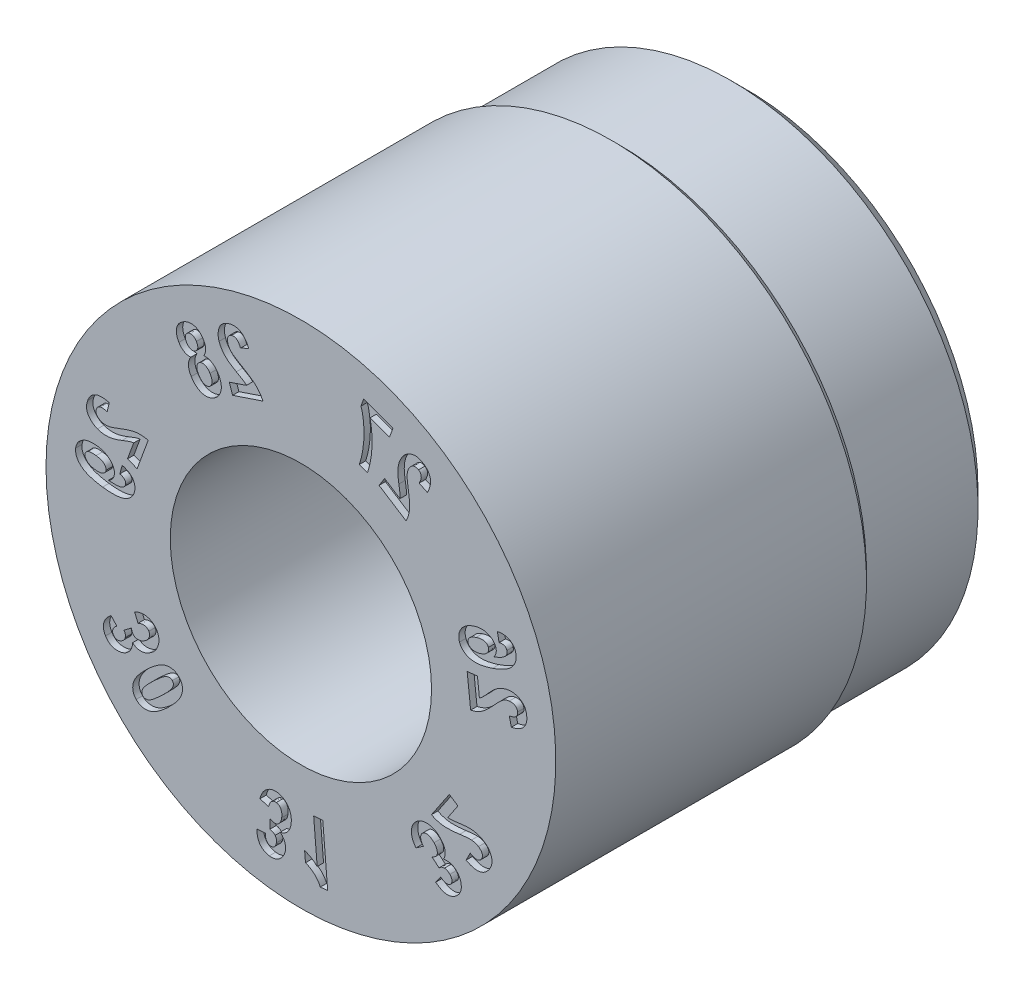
from build123d import *

# Parameters (mm, degrees)
CUT_EXTRUDE3_DEPTH = 0.2


with BuildPart() as part:
    # Sketch2 → Revolve1 (revolve)
    with BuildSketch(Plane(origin=(0, 0, 0), x_dir=(1, 0, 0), z_dir=(0, 1, 0)), mode=Mode.PRIVATE) as revolve1_sk:
        Polygon((7.249621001, 14), (2, 14), (2, 10), (4.1, 10), (4.1, 0), (8, 0), (8, 9.75), (7.75, 10), (7.75, 13.499621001), align=None)
    revolve(revolve1_sk.sketch.rotate(Axis((0, 0, -4.849143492), (0, 0, 1)), 180), axis=Axis((0, 0, -4.849143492), (0, 0, 1)))

    # Sketch9 → Cut-Extrude3 (cut)
    # profile 1 of 14: a face of its own
    with BuildSketch(Plane.XY):
        with BuildLine():
            Line((5.540256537, 1.084718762), (5.217850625, 1.0495522))
            Line((5.217850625, 1.0495522), (5.326705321, 0.051684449))
            add(Edge.make_bspline(
                [(5.326705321, 0.051684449), (5.356533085, 0.058359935), (5.416039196, 0.071677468), (5.501985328, 0.102682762), (5.585107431, 0.140552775), (5.651997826, 0.17945346), (5.705428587, 0.216492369), (5.748733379, 0.249090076), (5.794222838, 0.287380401), (5.842716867, 0.330539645), (5.893335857, 0.37951837), (5.9475489, 0.432737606), (6.003647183, 0.491990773), (6.041703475, 0.533398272), (6.061391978, 0.554820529)],
                knots=[0, 0, 0, 0, 1.210903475, 2.415741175, 3.614422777, 4.829304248, 5.477408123, 6.191639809, 6.977581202, 7.834306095, 8.765204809, 9.770030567, 10.846320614, 12, 12, 12, 12], degree=3))
            add(Edge.make_bspline(
                [(6.061391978, 0.554820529), (6.076818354, 0.571627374), (6.106260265, 0.603703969), (6.14888155, 0.648979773), (6.187412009, 0.689437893), (6.222816, 0.724303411), (6.253434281, 0.75500191), (6.280588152, 0.780453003), (6.303881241, 0.800908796), (6.318743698, 0.812216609), (6.325362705, 0.817252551)],
                knots=[0, 0, 0, 0, 1.469359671, 2.804336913, 4.005076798, 5.067497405, 6.004650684, 6.797449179, 7.46444311, 8, 8, 8, 8], degree=3))
            add(Edge.make_bspline(
                [(6.325362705, 0.817252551), (6.342361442, 0.829098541), (6.375500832, 0.852192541), (6.429082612, 0.878292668), (6.483544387, 0.896918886), (6.520811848, 0.902752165), (6.539217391, 0.905633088)],
                knots=[0, 0, 0, 0, 1.061115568, 2.068666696, 3.046158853, 4, 4, 4, 4], degree=3))
            add(Edge.make_bspline(
                [(6.539217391, 0.905633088), (6.557906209, 0.907217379), (6.593151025, 0.910205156), (6.643287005, 0.905157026), (6.687215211, 0.89337813), (6.724366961, 0.873435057), (6.754705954, 0.847415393), (6.777600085, 0.815654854), (6.79359, 0.779115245), (6.797747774, 0.752518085), (6.799884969, 0.738846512)],
                knots=[0, 0, 0, 0, 1.284830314, 2.42303217, 3.43989917, 4.386563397, 5.292301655, 6.158766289, 7.053562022, 8, 8, 8, 8], degree=3))
            add(Edge.make_bspline(
                [(6.799884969, 0.738846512), (6.800732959, 0.72385297), (6.802364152, 0.695011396), (6.793374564, 0.653092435), (6.773924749, 0.616100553), (6.745369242, 0.583611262), (6.707041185, 0.556242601), (6.659334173, 0.534348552), (6.602777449, 0.515675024), (6.561345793, 0.508062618), (6.539284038, 0.504009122)],
                knots=[0, 0, 0, 0, 0.913722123, 1.757635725, 2.579276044, 3.438933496, 4.37433614, 5.431505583, 6.632314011, 8, 8, 8, 8], degree=3))
            Line((6.539284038, 0.504009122), (6.604886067, 0.225377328))
            add(Edge.make_bspline(
                [(6.604886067, 0.225377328), (6.626895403, 0.230210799), (6.669640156, 0.239597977), (6.730913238, 0.257539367), (6.78710615, 0.278711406), (6.838601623, 0.301906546), (6.884987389, 0.328069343), (6.92651984, 0.356761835), (6.963045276, 0.388406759), (6.994653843, 0.422701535), (7.021478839, 0.459509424), (7.044222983, 0.498379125), (7.062488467, 0.539545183), (7.075900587, 0.583047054), (7.085856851, 0.62848589), (7.09067678, 0.676268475), (7.091019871, 0.726276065), (7.088181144, 0.760142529), (7.086724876, 0.777516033)],
                knots=[0, 0, 0, 0, 1.316678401, 2.557146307, 3.727226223, 4.823655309, 5.854584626, 6.835260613, 7.768888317, 8.673026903, 9.554907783, 10.425565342, 11.300463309, 12.180346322, 13.081818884, 14.014614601, 14.981496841, 16, 16, 16, 16], degree=3))
            add(Edge.make_bspline(
                [(7.086724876, 0.777516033), (7.084164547, 0.796348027), (7.079198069, 0.832877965), (7.066631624, 0.885508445), (7.049131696, 0.933716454), (7.027730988, 0.978241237), (7.001357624, 1.018176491), (6.970965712, 1.054498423), (6.935669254, 1.086129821), (6.896680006, 1.113597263), (6.855248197, 1.137231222), (6.812335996, 1.156838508), (6.768469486, 1.172660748), (6.723743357, 1.184912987), (6.677958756, 1.192819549), (6.631249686, 1.197512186), (6.583537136, 1.198007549), (6.551558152, 1.1951688), (6.535440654, 1.193738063)],
                knots=[0, 0, 0, 0, 1.173652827, 2.276629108, 3.335023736, 4.336619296, 5.321091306, 6.283820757, 7.254537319, 8.239831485, 9.225125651, 10.197062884, 11.150738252, 12.103199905, 13.057936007, 14.017536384, 15.000832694, 16, 16, 16, 16], degree=3))
            add(Edge.make_bspline(
                [(6.535440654, 1.193738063), (6.51706808, 1.191372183), (6.480494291, 1.186662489), (6.426778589, 1.174523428), (6.374207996, 1.159162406), (6.322708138, 1.140346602), (6.272114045, 1.117228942), (6.221987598, 1.090226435), (6.172064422, 1.059042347), (6.130638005, 1.029798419), (6.096863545, 1.003443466), (6.070097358, 0.980221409), (6.041581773, 0.954437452), (6.011586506, 0.92570387), (5.979791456, 0.894649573), (5.94685471, 0.860226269), (5.912056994, 0.823290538), (5.8886106, 0.797388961), (5.876576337, 0.784094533)],
                knots=[0, 0, 0, 0, 1.116805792, 2.223195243, 3.31725657, 4.418851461, 5.527133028, 6.669491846, 7.850789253, 9.075422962, 9.72636706, 10.433968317, 11.212223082, 12.045064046, 12.93920453, 13.892729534, 14.918407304, 16, 16, 16, 16], degree=3))
            add(Edge.make_bspline(
                [(5.876576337, 0.784094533), (5.86542949, 0.771793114), (5.844192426, 0.748356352), (5.813775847, 0.715079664), (5.785910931, 0.685684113), (5.761961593, 0.658848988), (5.739821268, 0.636600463), (5.721522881, 0.617052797), (5.705589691, 0.601584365), (5.681874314, 0.578671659), (5.648795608, 0.549823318), (5.617039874, 0.529188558), (5.601785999, 0.519276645)],
                knots=[0, 0, 0, 0, 1.30077431, 2.478245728, 3.532467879, 4.474445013, 5.295791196, 5.991390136, 6.572169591, 7.035389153, 8.575948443, 10, 10, 10, 10], degree=3))
            Line((5.601785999, 0.519276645), (5.540256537, 1.084718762))
        make_face()
    # profile 2 of 14: a face of its own
    with BuildSketch(Plane.XY):
        with BuildLine():
            Line((6.166192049, 2.608257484), (6.220022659, 2.333696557))
            add(Edge.make_bspline(
                [(6.220022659, 2.333696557), (6.235803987, 2.337124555), (6.265581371, 2.343592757), (6.30867596, 2.346743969), (6.347155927, 2.344737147), (6.380780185, 2.336122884), (6.410102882, 2.32245267), (6.43418276, 2.302178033), (6.453314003, 2.276011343), (6.461518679, 2.255695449), (6.465791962, 2.245114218)],
                knots=[0, 0, 0, 0, 1.330334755, 2.510174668, 3.553125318, 4.493430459, 5.356099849, 6.19851809, 7.061724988, 8, 8, 8, 8], degree=3))
            add(Edge.make_bspline(
                [(6.465791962, 2.245114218), (6.467937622, 2.237800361), (6.472183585, 2.223327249), (6.474902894, 2.200868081), (6.473686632, 2.178349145), (6.469375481, 2.15580611), (6.461973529, 2.133053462), (6.450573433, 2.110524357), (6.436181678, 2.087834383), (6.418465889, 2.064589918), (6.395695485, 2.040814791), (6.366039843, 2.017228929), (6.330216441, 1.992590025), (6.287861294, 1.967141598), (6.238758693, 1.941338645), (6.183160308, 1.914431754), (6.121048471, 1.886702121), (6.077194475, 1.868738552), (6.054313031, 1.859365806)],
                knots=[0, 0, 0, 0, 0.592904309, 1.173275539, 1.751425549, 2.342155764, 2.956377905, 3.608061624, 4.302617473, 5.046745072, 5.880567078, 6.858832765, 7.991524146, 9.265112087, 10.704042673, 12.30969237, 14.074529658, 16, 16, 16, 16], degree=3))
            add(Edge.make_bspline(
                [(6.054313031, 1.859365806), (6.063037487, 1.871798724), (6.079964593, 1.895920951), (6.100682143, 1.933668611), (6.11548088, 1.971626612), (6.126341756, 2.009198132), (6.131422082, 2.047005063), (6.131586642, 2.084801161), (6.126564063, 2.122769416), (6.119057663, 2.147341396), (6.11524554, 2.159820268)],
                knots=[0, 0, 0, 0, 1.139468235, 2.210785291, 3.221715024, 4.191838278, 5.139167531, 6.074298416, 7.022033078, 8, 8, 8, 8], degree=3))
            add(Edge.make_bspline(
                [(6.11524554, 2.159820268), (6.110109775, 2.173315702), (6.099922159, 2.200086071), (6.079000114, 2.237446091), (6.053498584, 2.271668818), (6.023789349, 2.302934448), (5.989585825, 2.331355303), (5.95092292, 2.356528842), (5.907874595, 2.378664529), (5.861249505, 2.397826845), (5.811415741, 2.413096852), (5.75907616, 2.423179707), (5.704967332, 2.428557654), (5.648942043, 2.429366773), (5.591233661, 2.424057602), (5.531602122, 2.414754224), (5.470140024, 2.400207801), (5.429164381, 2.387050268), (5.408128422, 2.380295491)],
                knots=[0, 0, 0, 0, 0.842053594, 1.670348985, 2.489711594, 3.327769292, 4.182061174, 5.079771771, 6.015342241, 7.003867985, 8.018865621, 9.052517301, 10.10990296, 11.189593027, 12.317839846, 13.488410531, 14.71060735, 16, 16, 16, 16], degree=3))
            add(Edge.make_bspline(
                [(5.408128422, 2.380295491), (5.386042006, 2.372411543), (5.343108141, 2.357085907), (5.282321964, 2.329306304), (5.226422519, 2.299192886), (5.175714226, 2.265788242), (5.129991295, 2.229763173), (5.089134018, 2.191097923), (5.053603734, 2.149159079), (5.023516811, 2.104582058), (4.998667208, 2.058526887), (4.9789332, 2.012004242), (4.964747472, 1.965196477), (4.956625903, 1.917999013), (4.953509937, 1.870589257), (4.956211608, 1.822837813), (4.963947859, 1.774578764), (4.973757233, 1.743157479), (4.9787359, 1.727209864)],
                knots=[0, 0, 0, 0, 1.28535219, 2.498600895, 3.66049551, 4.763734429, 5.82358132, 6.84854775, 7.842826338, 8.831129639, 9.792013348, 10.707960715, 11.597792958, 12.467321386, 13.328372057, 14.19714035, 15.084973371, 16, 16, 16, 16], degree=3))
            add(Edge.make_bspline(
                [(4.9787359, 1.727209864), (4.985222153, 1.71012925), (4.998027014, 1.676409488), (5.024888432, 1.629734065), (5.056943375, 1.587377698), (5.094598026, 1.549351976), (5.138241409, 1.516475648), (5.186819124, 1.487163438), (5.241401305, 1.463313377), (5.301264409, 1.443089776), (5.367628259, 1.429004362), (5.440646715, 1.422102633), (5.520451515, 1.423123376), (5.606884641, 1.430691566), (5.70005235, 1.445591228), (5.799873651, 1.467529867), (5.906431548, 1.49714698), (5.979171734, 1.520890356), (6.016898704, 1.533204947)],
                knots=[0, 0, 0, 0, 0.743322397, 1.46743283, 2.184580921, 2.902395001, 3.639568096, 4.405059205, 5.208335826, 6.060957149, 6.975334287, 7.96520218, 9.042425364, 10.222078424, 11.496819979, 12.883183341, 14.383451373, 16, 16, 16, 16], degree=3))
            add(Edge.make_bspline(
                [(6.016898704, 1.533204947), (6.054995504, 1.546478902), (6.128490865, 1.572086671), (6.232261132, 1.615570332), (6.326734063, 1.659480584), (6.410921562, 1.706138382), (6.485669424, 1.753848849), (6.550687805, 1.803374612), (6.605449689, 1.855073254), (6.65042397, 1.908555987), (6.687021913, 1.962728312), (6.7154946, 2.017724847), (6.737715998, 2.072700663), (6.751491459, 2.128428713), (6.757942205, 2.184389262), (6.757451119, 2.240733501), (6.748926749, 2.297529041), (6.737784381, 2.334478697), (6.732136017, 2.353209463)],
                knots=[0, 0, 0, 0, 1.590623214, 3.068589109, 4.435088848, 5.697077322, 6.861449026, 7.929522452, 8.91549332, 9.824912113, 10.680046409, 11.488073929, 12.263229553, 13.013100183, 13.744384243, 14.479413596, 15.229174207, 16, 16, 16, 16], degree=3))
            add(Edge.make_bspline(
                [(6.732136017, 2.353209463), (6.727506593, 2.36587587), (6.718349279, 2.390930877), (6.700797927, 2.426296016), (6.680456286, 2.459036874), (6.656889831, 2.488845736), (6.63075944, 2.516181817), (6.601873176, 2.541015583), (6.569971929, 2.562709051), (6.535547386, 2.582038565), (6.498378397, 2.59831939), (6.458423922, 2.61049218), (6.416073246, 2.619028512), (6.371127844, 2.624426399), (6.323421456, 2.625593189), (6.273111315, 2.623711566), (6.220264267, 2.618229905), (6.184556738, 2.611644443), (6.166192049, 2.608257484)],
                knots=[0, 0, 0, 0, 0.942722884, 1.864769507, 2.755859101, 3.634209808, 4.517610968, 5.397479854, 6.293382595, 7.211480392, 8.155735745, 9.125710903, 10.126944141, 11.174289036, 12.287857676, 13.461023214, 14.694182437, 16, 16, 16, 16], degree=3))
        make_face()
        with BuildLine():
            add(Edge.make_bspline(
                [(5.653403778, 1.749283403), (5.64008522, 1.744892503), (5.61429773, 1.736390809), (5.575958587, 1.726630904), (5.539434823, 1.719401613), (5.504547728, 1.714942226), (5.471393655, 1.712988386), (5.440087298, 1.714298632), (5.410432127, 1.717554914), (5.38287166, 1.724293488), (5.357345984, 1.732373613), (5.334365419, 1.742608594), (5.31392129, 1.754238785), (5.295399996, 1.7666604), (5.280119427, 1.781353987), (5.26686447, 1.797120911), (5.256087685, 1.81451433), (5.251219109, 1.827194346), (5.248796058, 1.833505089)],
                knots=[0, 0, 0, 0, 1.477315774, 2.860389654, 4.165661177, 5.398195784, 6.564007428, 7.660189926, 8.696724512, 9.701606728, 10.644280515, 11.51494483, 12.346158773, 13.121548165, 13.857295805, 14.571221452, 15.28890834, 16, 16, 16, 16], degree=3))
            add(Edge.make_bspline(
                [(5.248796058, 1.833505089), (5.245468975, 1.846041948), (5.238920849, 1.870716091), (5.242308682, 1.909755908), (5.254555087, 1.948206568), (5.273333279, 1.978784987), (5.293164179, 2.002707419), (5.312236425, 2.020423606), (5.334722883, 2.037603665), (5.360490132, 2.054144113), (5.38977529, 2.069764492), (5.421973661, 2.085513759), (5.458064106, 2.099815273), (5.483316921, 2.108907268), (5.496430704, 2.113628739)],
                knots=[0, 0, 0, 0, 1.112703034, 2.189941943, 3.328406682, 4.57426261, 5.260445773, 6.008428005, 6.816492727, 7.702117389, 8.649537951, 9.681760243, 10.796138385, 12, 12, 12, 12], degree=3))
            add(Edge.make_bspline(
                [(5.496430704, 2.113628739), (5.510125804, 2.118115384), (5.536619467, 2.126794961), (5.575574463, 2.137269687), (5.6122737, 2.145037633), (5.64663857, 2.149939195), (5.678699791, 2.153090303), (5.708464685, 2.152403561), (5.73611591, 2.149990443), (5.768799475, 2.142436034), (5.80512085, 2.128870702), (5.841341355, 2.104600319), (5.869443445, 2.073556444), (5.879995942, 2.04851079), (5.885296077, 2.035931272)],
                knots=[0, 0, 0, 0, 1.175356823, 2.273770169, 3.288782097, 4.232920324, 5.10476178, 5.912420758, 6.658286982, 7.364144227, 8.643709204, 9.796412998, 10.893218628, 12, 12, 12, 12], degree=3))
            add(Edge.make_bspline(
                [(5.885296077, 2.035931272), (5.888702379, 2.023036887), (5.89547131, 1.997413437), (5.893027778, 1.95662673), (5.879784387, 1.916352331), (5.86084945, 1.883984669), (5.840760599, 1.858867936), (5.82253783, 1.840164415), (5.801299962, 1.822533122), (5.777269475, 1.805942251), (5.750239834, 1.790554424), (5.720616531, 1.775608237), (5.688036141, 1.761803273), (5.665159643, 1.75353324), (5.653403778, 1.749283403)],
                knots=[0, 0, 0, 0, 1.163881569, 2.312840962, 3.522987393, 4.854472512, 5.577293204, 6.340826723, 7.140534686, 7.994669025, 8.898739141, 9.866531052, 10.903644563, 12, 12, 12, 12], degree=3))
        make_face(mode=Mode.SUBTRACT)
    # profile 3 of 14: a face of its own
    with BuildSketch(Plane.XY):
        with BuildLine():
            Line((2.628040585, 4.997886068), (2.452642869, 4.724070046))
            Line((2.452642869, 4.724070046), (3.300997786, 4.181012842))
            add(Edge.make_bspline(
                [(3.300997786, 4.181012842), (3.314510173, 4.20856118), (3.341413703, 4.263410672), (3.371260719, 4.350042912), (3.393773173, 4.438811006), (3.405638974, 4.515512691), (3.410782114, 4.580551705), (3.411837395, 4.634994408), (3.411171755, 4.694668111), (3.407468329, 4.759735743), (3.401589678, 4.830078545), (3.394095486, 4.906039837), (3.383068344, 4.987159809), (3.374753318, 5.043014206), (3.370463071, 5.071833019)],
                knots=[0, 0, 0, 0, 1.211637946, 2.412404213, 3.612933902, 4.827372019, 5.47430143, 6.190152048, 6.978559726, 7.832321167, 8.765076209, 9.768234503, 10.848491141, 12, 12, 12, 12], degree=3))
            add(Edge.make_bspline(
                [(3.370463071, 5.071833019), (3.367049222, 5.09440515), (3.360519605, 5.137578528), (3.351815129, 5.199243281), (3.344897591, 5.254886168), (3.339558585, 5.304433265), (3.335231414, 5.347788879), (3.332173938, 5.385043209), (3.331072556, 5.416131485), (3.331433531, 5.43487141), (3.331593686, 5.443185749)],
                knots=[0, 0, 0, 0, 1.465895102, 2.8037957, 3.998778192, 5.066181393, 6.003677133, 6.796580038, 7.466078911, 8, 8, 8, 8], degree=3))
            add(Edge.make_bspline(
                [(3.331593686, 5.443185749), (3.333246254, 5.46389316), (3.336473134, 5.504327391), (3.349217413, 5.56272422), (3.369048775, 5.61707675), (3.38807438, 5.649810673), (3.397504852, 5.666035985)],
                knots=[0, 0, 0, 0, 1.059875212, 2.069560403, 3.043133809, 4, 4, 4, 4], degree=3))
            add(Edge.make_bspline(
                [(3.397504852, 5.666035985), (3.408140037, 5.681485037), (3.428221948, 5.710656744), (3.462997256, 5.747336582), (3.500021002, 5.774058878), (3.538888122, 5.790443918), (3.578190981, 5.797389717), (3.617325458, 5.796128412), (3.655786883, 5.784919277), (3.679167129, 5.771552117), (3.691230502, 5.764655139)],
                knots=[0, 0, 0, 0, 1.283673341, 2.423899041, 3.444563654, 4.389784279, 5.287846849, 6.159174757, 7.050199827, 8, 8, 8, 8], degree=3))
            add(Edge.make_bspline(
                [(3.691230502, 5.764655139), (3.703477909, 5.755847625), (3.726990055, 5.738939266), (3.753824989, 5.705383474), (3.771025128, 5.66717927), (3.778425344, 5.624293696), (3.775608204, 5.577119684), (3.762707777, 5.526091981), (3.741625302, 5.470316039), (3.721684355, 5.433179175), (3.711059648, 5.413392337)],
                knots=[0, 0, 0, 0, 0.914998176, 1.756581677, 2.581005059, 3.440811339, 4.379414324, 5.436370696, 6.634076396, 8, 8, 8, 8], degree=3))
            Line((3.711059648, 5.413392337), (3.970265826, 5.289012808))
            add(Edge.make_bspline(
                [(3.970265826, 5.289012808), (3.980355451, 5.30929888), (3.999951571, 5.348698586), (4.024196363, 5.407920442), (4.043436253, 5.464914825), (4.057259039, 5.519745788), (4.06623068, 5.572453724), (4.069955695, 5.622992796), (4.068200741, 5.671434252), (4.061155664, 5.717754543), (4.04923661, 5.761938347), (4.033034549, 5.804213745), (4.012479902, 5.844539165), (3.986935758, 5.882614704), (3.957164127, 5.918739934), (3.922929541, 5.952702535), (3.884512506, 5.984975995), (3.856103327, 6.003823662), (3.841561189, 6.013471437)],
                knots=[0, 0, 0, 0, 1.31855266, 2.56089937, 3.721872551, 4.817576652, 5.849184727, 6.830636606, 7.762264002, 8.664941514, 9.55209577, 10.421119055, 11.296149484, 12.180985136, 13.08485663, 14.016732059, 14.984801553, 16, 16, 16, 16], degree=3))
            add(Edge.make_bspline(
                [(3.841561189, 6.013471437), (3.825236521, 6.023392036), (3.793600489, 6.042617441), (3.744457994, 6.065444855), (3.695919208, 6.082276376), (3.647704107, 6.093516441), (3.59981398, 6.098347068), (3.552297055, 6.096965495), (3.505386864, 6.089602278), (3.459439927, 6.076308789), (3.415256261, 6.058425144), (3.372699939, 6.037745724), (3.332641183, 6.013596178), (3.29516247, 5.985886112), (3.259787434, 5.955524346), (3.22736579, 5.921344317), (3.196484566, 5.884714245), (3.178585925, 5.857861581), (3.16955052, 5.844306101)],
                knots=[0, 0, 0, 0, 1.175684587, 2.278392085, 3.329300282, 4.334649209, 5.320194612, 6.284785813, 7.25428016, 8.236437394, 9.223410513, 10.186481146, 11.147580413, 12.09912404, 13.054044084, 14.014186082, 14.997542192, 16, 16, 16, 16], degree=3))
            add(Edge.make_bspline(
                [(3.16955052, 5.844306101), (3.159911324, 5.828418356), (3.14072523, 5.796794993), (3.115973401, 5.7474015), (3.094741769, 5.69673146), (3.077262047, 5.644580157), (3.063217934, 5.590589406), (3.053051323, 5.534333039), (3.045831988, 5.475688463), (3.043130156, 5.424885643), (3.042191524, 5.381799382), (3.043588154, 5.346240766), (3.045218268, 5.307738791), (3.049179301, 5.266312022), (3.053194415, 5.221868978), (3.059518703, 5.174426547), (3.066344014, 5.123977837), (3.071947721, 5.089404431), (3.074834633, 5.071592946)],
                knots=[0, 0, 0, 0, 1.11659229, 2.222493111, 3.317022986, 4.416219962, 5.52565493, 6.66710033, 7.849887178, 9.074698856, 9.723357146, 10.439414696, 11.21299271, 12.039239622, 12.940170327, 13.894945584, 14.915520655, 16, 16, 16, 16], degree=3))
            add(Edge.make_bspline(
                [(3.074834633, 5.071592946), (3.077352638, 5.055265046), (3.082174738, 5.023996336), (3.089122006, 4.979417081), (3.094865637, 4.939155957), (3.100318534, 4.903540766), (3.103820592, 4.872269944), (3.107447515, 4.845570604), (3.10953852, 4.823316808), (3.112748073, 4.79019439), (3.114015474, 4.746151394), (3.110350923, 4.708267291), (3.108598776, 4.690153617)],
                knots=[0, 0, 0, 0, 1.290215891, 2.470825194, 3.523375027, 4.466334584, 5.284205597, 5.980476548, 6.570311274, 7.029475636, 8.579691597, 10, 10, 10, 10], degree=3))
            Line((3.108598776, 4.690153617), (2.628040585, 4.997886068))
        make_face()
    # profile 4 of 14: a face of its own
    with BuildSketch(Plane.XY):
        with BuildLine():
            Line((2.778921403, 6.193518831), (2.889745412, 6.497826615))
            Line((2.889745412, 6.497826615), (1.971391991, 6.83244651))
            Line((1.971391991, 6.83244651), (1.884645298, 6.594724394))
            add(Edge.make_bspline(
                [(1.884645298, 6.594724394), (1.889893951, 6.579400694), (1.900742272, 6.547728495), (1.914508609, 6.497876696), (1.927361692, 6.44453655), (1.938723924, 6.387447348), (1.949375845, 6.326683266), (1.958254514, 6.262229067), (1.965924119, 6.194198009), (1.975113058, 6.098584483), (1.9819622, 5.975399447), (1.981797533, 5.825235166), (1.97367818, 5.672843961), (1.95952115, 5.545369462), (1.945112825, 5.444000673), (1.932549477, 5.369984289), (1.91915781, 5.298176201), (1.903811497, 5.22890461), (1.887485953, 5.162017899), (1.869289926, 5.097643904), (1.850754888, 5.035250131), (1.836368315, 4.994978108), (1.829275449, 4.975123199)],
                knots=[0, 0, 0, 0, 0.590373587, 1.220229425, 1.884450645, 2.59024717, 3.341856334, 4.133111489, 4.961669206, 5.837553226, 7.634611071, 9.456723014, 11.30932024, 13.195067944, 14.130325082, 15.041640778, 15.931758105, 16.792928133, 17.627878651, 18.441287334, 19.231523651, 20, 20, 20, 20], degree=3))
            Line((1.829275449, 4.975123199), (2.088344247, 4.881063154))
            add(Edge.make_bspline(
                [(2.088344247, 4.881063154), (2.098195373, 4.911809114), (2.117914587, 4.973353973), (2.143603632, 5.066961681), (2.166902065, 5.161480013), (2.18577251, 5.25738165), (2.202038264, 5.354245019), (2.215296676, 5.452242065), (2.225350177, 5.551367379), (2.231526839, 5.651293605), (2.235394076, 5.751058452), (2.235209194, 5.849959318), (2.232392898, 5.947615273), (2.225944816, 6.043840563), (2.216859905, 6.138885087), (2.203724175, 6.232497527), (2.188146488, 6.325002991), (2.174781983, 6.38578832), (2.168133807, 6.416025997)],
                knots=[0, 0, 0, 0, 0.996162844, 1.99404086, 2.994684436, 3.999415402, 5.009253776, 6.025211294, 7.050416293, 8.082977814, 9.114161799, 10.13071572, 11.134239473, 12.128350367, 13.106171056, 14.079761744, 15.044776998, 16, 16, 16, 16], degree=3))
            Line((2.168133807, 6.416025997), (2.778921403, 6.193518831))
        make_face()
    # profile 5 of 14: a face of its own
    with BuildSketch(Plane.XY):
        with BuildLine():
            Line((-2.248228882, 5.179094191), (-2.144880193, 4.871801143))
            Line((-2.144880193, 4.871801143), (-1.193730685, 5.191538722))
            add(Edge.make_bspline(
                [(-1.193730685, 5.191538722), (-1.206745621, 5.219246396), (-1.23265436, 5.274403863), (-1.280916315, 5.351994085), (-1.335684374, 5.425118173), (-1.388060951, 5.482152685), (-1.43537799, 5.526839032), (-1.47695342, 5.561534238), (-1.523671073, 5.598291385), (-1.576733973, 5.63561851), (-1.63456188, 5.675853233), (-1.698730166, 5.716385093), (-1.768081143, 5.759086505), (-1.816630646, 5.787251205), (-1.841746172, 5.801821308)],
                knots=[0, 0, 0, 0, 1.213344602, 2.415396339, 3.616614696, 4.832785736, 5.481411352, 6.196944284, 6.979833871, 7.83856891, 8.769679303, 9.77383743, 10.848366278, 12, 12, 12, 12], degree=3))
            add(Edge.make_bspline(
                [(-1.841746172, 5.801821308), (-1.86145663, 5.813269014), (-1.899077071, 5.835118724), (-1.952448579, 5.866941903), (-2.000119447, 5.896133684), (-2.042154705, 5.922604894), (-2.078243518, 5.946676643), (-2.109221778, 5.967262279), (-2.134006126, 5.985790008), (-2.148168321, 5.997817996), (-2.154428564, 6.003134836)],
                knots=[0, 0, 0, 0, 1.469432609, 2.804638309, 4.005771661, 5.073045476, 6.006764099, 6.802333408, 7.470584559, 8, 8, 8, 8], degree=3))
            add(Edge.make_bspline(
                [(-2.154428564, 6.003134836), (-2.169706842, 6.01727371), (-2.199466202, 6.044813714), (-2.236472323, 6.091574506), (-2.266562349, 6.14070471), (-2.280048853, 6.175924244), (-2.286745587, 6.193412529)],
                knots=[0, 0, 0, 0, 1.064219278, 2.072909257, 3.04310172, 4, 4, 4, 4], degree=3))
            add(Edge.make_bspline(
                [(-2.286745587, 6.193412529), (-2.29222432, 6.211351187), (-2.302546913, 6.245149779), (-2.308484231, 6.295156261), (-2.306860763, 6.34064395), (-2.295079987, 6.381123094), (-2.275808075, 6.415856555), (-2.250466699, 6.445484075), (-2.217958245, 6.468647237), (-2.192883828, 6.478447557), (-2.180000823, 6.483482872)],
                knots=[0, 0, 0, 0, 1.286477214, 2.423877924, 3.44414983, 4.393245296, 5.290766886, 6.155108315, 7.052111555, 8, 8, 8, 8], degree=3))
            add(Edge.make_bspline(
                [(-2.180000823, 6.483482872), (-2.165515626, 6.487601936), (-2.13763121, 6.495531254), (-2.094721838, 6.494718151), (-2.054241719, 6.484541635), (-2.016471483, 6.463156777), (-1.981786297, 6.431477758), (-1.949959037, 6.389652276), (-1.919984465, 6.338407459), (-1.903753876, 6.299671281), (-1.895148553, 6.279133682)],
                knots=[0, 0, 0, 0, 0.915446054, 1.762259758, 2.586675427, 3.441795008, 4.384146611, 5.436996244, 6.641116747, 8, 8, 8, 8], degree=3))
            Line((-1.895148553, 6.279133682), (-1.636719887, 6.402892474))
            add(Edge.make_bspline(
                [(-1.636719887, 6.402892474), (-1.646281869, 6.423398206), (-1.664792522, 6.463094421), (-1.695089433, 6.519295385), (-1.727234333, 6.569911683), (-1.761445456, 6.614779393), (-1.79644116, 6.654843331), (-1.833622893, 6.689059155), (-1.872256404, 6.718055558), (-1.912477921, 6.741778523), (-1.954467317, 6.759744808), (-1.997354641, 6.773750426), (-2.041668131, 6.782720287), (-2.086965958, 6.786737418), (-2.133586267, 6.786147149), (-2.181245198, 6.780751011), (-2.230303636, 6.770821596), (-2.262653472, 6.760638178), (-2.279237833, 6.75541758)],
                knots=[0, 0, 0, 0, 1.321590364, 2.558413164, 3.727230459, 4.820384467, 5.851850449, 6.830887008, 7.766402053, 8.669252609, 9.551502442, 10.429373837, 11.300769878, 12.186559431, 13.081238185, 14.019844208, 14.984859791, 16, 16, 16, 16], degree=3))
            add(Edge.make_bspline(
                [(-2.279237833, 6.75541758), (-2.297083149, 6.748944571), (-2.331800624, 6.736351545), (-2.380272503, 6.712638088), (-2.423764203, 6.685361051), (-2.462336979, 6.654818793), (-2.496241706, 6.620830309), (-2.524846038, 6.583229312), (-2.548709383, 6.542269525), (-2.566781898, 6.498189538), (-2.580380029, 6.45259707), (-2.590813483, 6.406637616), (-2.597216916, 6.360496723), (-2.599253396, 6.314130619), (-2.597421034, 6.267594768), (-2.591725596, 6.220833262), (-2.581757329, 6.174013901), (-2.572287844, 6.143304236), (-2.567509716, 6.127808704)],
                knots=[0, 0, 0, 0, 1.172031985, 2.280149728, 3.325978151, 4.337656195, 5.313101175, 6.28355329, 7.248177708, 8.232945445, 9.218652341, 10.184564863, 11.14172639, 12.092036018, 13.047716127, 14.015512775, 14.998664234, 16, 16, 16, 16], degree=3))
            add(Edge.make_bspline(
                [(-2.567509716, 6.127808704), (-2.561283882, 6.11037713), (-2.548906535, 6.075722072), (-2.525538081, 6.025771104), (-2.499420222, 5.977639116), (-2.469455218, 5.931557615), (-2.436164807, 5.887132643), (-2.399158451, 5.843794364), (-2.35785612, 5.801954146), (-2.320478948, 5.767747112), (-2.287489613, 5.740515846), (-2.259464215, 5.718916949), (-2.228169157, 5.696640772), (-2.193780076, 5.673463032), (-2.156482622, 5.6493667), (-2.115997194, 5.624367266), (-2.072676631, 5.597997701), (-2.04229216, 5.58084561), (-2.026680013, 5.572032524)],
                knots=[0, 0, 0, 0, 1.116552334, 2.219775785, 3.324099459, 4.419313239, 5.533787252, 6.672490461, 7.855744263, 9.079813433, 9.728580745, 10.436896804, 11.214743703, 12.046467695, 12.939573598, 13.894393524, 14.918097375, 16, 16, 16, 16], degree=3))
            add(Edge.make_bspline(
                [(-2.026680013, 5.572032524), (-2.012343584, 5.563757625), (-1.984958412, 5.547951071), (-1.946062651, 5.52515249), (-1.910972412, 5.504995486), (-1.88035, 5.486268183), (-1.853268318, 5.470401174), (-1.830362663, 5.45629869), (-1.811921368, 5.443793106), (-1.784151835, 5.426025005), (-1.749550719, 5.399172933), (-1.722388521, 5.372921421), (-1.709360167, 5.360329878)],
                knots=[0, 0, 0, 0, 1.297730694, 2.478900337, 3.534603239, 4.470131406, 5.29275881, 5.995383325, 6.578388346, 7.039332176, 8.579915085, 10, 10, 10, 10], degree=3))
            Line((-1.709360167, 5.360329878), (-2.248228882, 5.179094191))
        make_face()
    # profile 6 of 14: a face of its own
    with BuildSketch(Plane.XY):
        with BuildLine():
            add(Edge.make_bspline(
                [(-3.048239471, 5.499382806), (-3.038860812, 5.51616995), (-3.020443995, 5.549134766), (-3.001432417, 5.601736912), (-2.990601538, 5.655280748), (-2.98850101, 5.709648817), (-2.993957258, 5.764768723), (-3.008859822, 5.820180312), (-3.030873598, 5.87637845), (-3.05131722, 5.912274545), (-3.061856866, 5.930780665)],
                knots=[0, 0, 0, 0, 1.010101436, 1.983530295, 2.928105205, 3.872391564, 4.834970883, 5.829786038, 6.881152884, 8, 8, 8, 8], degree=3))
            add(Edge.make_bspline(
                [(-3.061856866, 5.930780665), (-3.071228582, 5.945530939), (-3.089553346, 5.974372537), (-3.120125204, 6.014189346), (-3.152574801, 6.049680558), (-3.186967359, 6.080778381), (-3.223305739, 6.107196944), (-3.261202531, 6.129793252), (-3.301206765, 6.147552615), (-3.342584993, 6.161574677), (-3.385166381, 6.170244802), (-3.428133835, 6.174831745), (-3.471436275, 6.174469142), (-3.514822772, 6.169006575), (-3.558334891, 6.158921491), (-3.602000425, 6.144106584), (-3.645784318, 6.124275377), (-3.67415026, 6.108073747), (-3.688653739, 6.09978987)],
                knots=[0, 0, 0, 0, 1.143103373, 2.2351401, 3.279863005, 4.286048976, 5.263513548, 6.215280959, 7.167491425, 8.122321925, 9.06837933, 10.004784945, 10.945373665, 11.8950252, 12.860499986, 13.863262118, 14.907488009, 16, 16, 16, 16], degree=3))
            add(Edge.make_bspline(
                [(-3.688653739, 6.09978987), (-3.703663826, 6.090309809), (-3.732800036, 6.071907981), (-3.772247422, 6.040583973), (-3.806410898, 6.007136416), (-3.836510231, 5.972318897), (-3.860380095, 5.934621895), (-3.880293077, 5.895663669), (-3.894665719, 5.854407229), (-3.903526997, 5.811442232), (-3.908480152, 5.7677296), (-3.909319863, 5.724042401), (-3.905862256, 5.680641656), (-3.898614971, 5.63759523), (-3.887891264, 5.594609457), (-3.872004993, 5.552272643), (-3.853019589, 5.509934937), (-3.837300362, 5.482786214), (-3.829322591, 5.469007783)],
                knots=[0, 0, 0, 0, 1.167980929, 2.267177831, 3.307543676, 4.312140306, 5.288597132, 6.236806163, 7.186813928, 8.154082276, 9.118665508, 10.078984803, 11.02553043, 11.980088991, 12.949798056, 13.936389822, 14.952683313, 16, 16, 16, 16], degree=3))
            add(Edge.make_bspline(
                [(-3.829322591, 5.469007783), (-3.817616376, 5.450977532), (-3.79488339, 5.415963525), (-3.754786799, 5.369730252), (-3.710866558, 5.331141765), (-3.663894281, 5.299772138), (-3.614350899, 5.275957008), (-3.563221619, 5.259495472), (-3.510377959, 5.251271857), (-3.474886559, 5.251604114), (-3.456973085, 5.251771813)],
                knots=[0, 0, 0, 0, 1.136313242, 2.206673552, 3.225544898, 4.220978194, 5.185440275, 6.124498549, 7.053383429, 8, 8, 8, 8], degree=3))
            add(Edge.make_bspline(
                [(-3.456973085, 5.251771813), (-3.468824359, 5.231980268), (-3.491904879, 5.193435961), (-3.515271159, 5.13111542), (-3.528853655, 5.067813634), (-3.531598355, 5.003072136), (-3.524817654, 4.937172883), (-3.507270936, 4.870063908), (-3.479710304, 4.801668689), (-3.454823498, 4.757481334), (-3.441944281, 4.734613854)],
                knots=[0, 0, 0, 0, 1.007365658, 1.961858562, 2.896100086, 3.828477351, 4.784351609, 5.783421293, 6.852894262, 8, 8, 8, 8], degree=3))
            add(Edge.make_bspline(
                [(-3.441944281, 4.734613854), (-3.427119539, 4.711710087), (-3.398160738, 4.666969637), (-3.347955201, 4.606731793), (-3.293314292, 4.554947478), (-3.234887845, 4.511927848), (-3.174163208, 4.477269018), (-3.111535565, 4.452429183), (-3.04763033, 4.437021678), (-2.982967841, 4.43165545), (-2.918445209, 4.435565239), (-2.855300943, 4.448959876), (-2.793262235, 4.470665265), (-2.754787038, 4.492318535), (-2.735172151, 4.503357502)],
                knots=[0, 0, 0, 0, 1.176921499, 2.299010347, 3.375685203, 4.418870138, 5.423737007, 6.385585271, 7.317429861, 8.251075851, 9.176107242, 10.097391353, 11.030038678, 12, 12, 12, 12], degree=3))
            add(Edge.make_bspline(
                [(-2.735172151, 4.503357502), (-2.720240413, 4.512862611), (-2.691060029, 4.531437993), (-2.651572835, 4.56404928), (-2.615969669, 4.598724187), (-2.585272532, 4.636827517), (-2.558904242, 4.677516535), (-2.537008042, 4.721113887), (-2.519504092, 4.767407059), (-2.506589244, 4.816091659), (-2.498477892, 4.866417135), (-2.496041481, 4.917695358), (-2.498498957, 4.969575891), (-2.507679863, 5.021649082), (-2.520829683, 5.074558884), (-2.540597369, 5.127524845), (-2.565236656, 5.181234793), (-2.585343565, 5.216066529), (-2.595659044, 5.23393631)],
                knots=[0, 0, 0, 0, 1.015346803, 1.984243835, 2.934214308, 3.864309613, 4.787044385, 5.713048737, 6.659858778, 7.62350836, 8.600236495, 9.580614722, 10.566100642, 11.575402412, 12.61140014, 13.692074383, 14.815961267, 16, 16, 16, 16], degree=3))
            add(Edge.make_bspline(
                [(-2.595659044, 5.23393631), (-2.6100389, 5.256078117), (-2.637876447, 5.298941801), (-2.686352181, 5.355948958), (-2.738804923, 5.4037697), (-2.795322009, 5.442208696), (-2.854882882, 5.471485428), (-2.917296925, 5.490947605), (-2.982162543, 5.501229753), (-3.026019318, 5.500003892), (-3.048239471, 5.499382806)],
                knots=[0, 0, 0, 0, 1.143832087, 2.214311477, 3.2344773, 4.212379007, 5.168194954, 6.101066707, 7.037900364, 8, 8, 8, 8], degree=3))
        make_face()
        with BuildLine():
            add(Edge.make_bspline(
                [(-3.280196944, 5.769896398), (-3.271963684, 5.755222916), (-3.256347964, 5.727392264), (-3.241243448, 5.684249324), (-3.234770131, 5.643046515), (-3.236758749, 5.604172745), (-3.247044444, 5.568476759), (-3.263898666, 5.536779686), (-3.287616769, 5.509345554), (-3.30746581, 5.495655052), (-3.31769807, 5.488597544)],
                knots=[0, 0, 0, 0, 1.264271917, 2.3978979, 3.418776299, 4.384720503, 5.302143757, 6.191451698, 7.067686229, 8, 8, 8, 8], degree=3))
            add(Edge.make_bspline(
                [(-3.31769807, 5.488597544), (-3.328811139, 5.482594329), (-3.350327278, 5.470971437), (-3.385920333, 5.462702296), (-3.42202434, 5.461824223), (-3.458485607, 5.469850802), (-3.494373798, 5.485588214), (-3.528159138, 5.510425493), (-3.559247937, 5.543962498), (-3.576667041, 5.570595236), (-3.585871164, 5.584667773)],
                knots=[0, 0, 0, 0, 0.942013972, 1.82384394, 2.706588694, 3.62577917, 4.595742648, 5.620313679, 6.74259174, 8, 8, 8, 8], degree=3))
            add(Edge.make_bspline(
                [(-3.585871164, 5.584667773), (-3.593848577, 5.598784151), (-3.609035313, 5.625657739), (-3.623452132, 5.667845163), (-3.629606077, 5.708558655), (-3.627005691, 5.747257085), (-3.617379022, 5.782802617), (-3.600992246, 5.814525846), (-3.577538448, 5.841619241), (-3.557737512, 5.854990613), (-3.54761955, 5.86182317)],
                knots=[0, 0, 0, 0, 1.236815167, 2.354545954, 3.385686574, 4.362722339, 5.296273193, 6.180467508, 7.070247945, 8, 8, 8, 8], degree=3))
            add(Edge.make_bspline(
                [(-3.54761955, 5.86182317), (-3.536458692, 5.86794363), (-3.514778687, 5.879832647), (-3.478786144, 5.888294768), (-3.442272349, 5.888761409), (-3.405570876, 5.881247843), (-3.369843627, 5.865376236), (-3.336385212, 5.841340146), (-3.305864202, 5.809003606), (-3.289030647, 5.783355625), (-3.280196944, 5.769896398)],
                knots=[0, 0, 0, 0, 0.957262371, 1.859485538, 2.757679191, 3.69594158, 4.664639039, 5.687163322, 6.786298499, 8, 8, 8, 8], degree=3))
        make_face(mode=Mode.SUBTRACT)
        with BuildLine():
            add(Edge.make_bspline(
                [(-2.854017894, 5.116069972), (-2.847988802, 5.105861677), (-2.836272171, 5.086023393), (-2.821812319, 5.055661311), (-2.809292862, 5.026434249), (-2.800228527, 4.997706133), (-2.793129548, 4.969952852), (-2.789499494, 4.942838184), (-2.787885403, 4.916548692), (-2.790125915, 4.883394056), (-2.798533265, 4.845195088), (-2.815868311, 4.804162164), (-2.841956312, 4.769887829), (-2.864912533, 4.753743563), (-2.876458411, 4.745623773)],
                knots=[0, 0, 0, 0, 1.032368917, 2.006253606, 2.927699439, 3.799890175, 4.628246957, 5.419965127, 6.179651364, 6.919079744, 8.308460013, 9.566258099, 10.7759446, 12, 12, 12, 12], degree=3))
            add(Edge.make_bspline(
                [(-2.876458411, 4.745623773), (-2.888972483, 4.739124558), (-2.913519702, 4.726375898), (-2.955068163, 4.718885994), (-2.997941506, 4.72171717), (-3.034126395, 4.731840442), (-3.063200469, 4.744759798), (-3.085225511, 4.758022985), (-3.106500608, 4.774476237), (-3.128134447, 4.793117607), (-3.148677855, 4.815373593), (-3.16924591, 4.840449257), (-3.189424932, 4.868406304), (-3.202038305, 4.888530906), (-3.20851059, 4.898857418)],
                knots=[0, 0, 0, 0, 1.235612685, 2.423739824, 3.660540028, 4.991159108, 5.707716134, 6.456727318, 7.247757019, 8.073081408, 8.967580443, 9.909592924, 10.927351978, 12, 12, 12, 12], degree=3))
            add(Edge.make_bspline(
                [(-3.20851059, 4.898857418), (-3.218576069, 4.916774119), (-3.237869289, 4.951116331), (-3.257019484, 5.004574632), (-3.265999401, 5.056400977), (-3.264909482, 5.105457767), (-3.2556741, 5.150734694), (-3.237184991, 5.190078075), (-3.211101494, 5.223898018), (-3.187902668, 5.239727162), (-3.176054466, 5.247811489)],
                knots=[0, 0, 0, 0, 1.260585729, 2.416254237, 3.468797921, 4.473114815, 5.414155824, 6.284527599, 7.123866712, 8, 8, 8, 8], degree=3))
            add(Edge.make_bspline(
                [(-3.176054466, 5.247811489), (-3.163537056, 5.254308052), (-3.138829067, 5.267131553), (-3.097077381, 5.274626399), (-3.05367743, 5.272272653), (-3.009209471, 5.259857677), (-2.965122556, 5.238236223), (-2.924355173, 5.205922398), (-2.88593816, 5.165451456), (-2.864980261, 5.133029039), (-2.854017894, 5.116069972)],
                knots=[0, 0, 0, 0, 0.869807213, 1.716903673, 2.59071616, 3.543939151, 4.558816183, 5.612352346, 6.751102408, 8, 8, 8, 8], degree=3))
        make_face(mode=Mode.SUBTRACT)
    # profile 7 of 14: a face of its own
    with BuildSketch(Plane.XY):
        with BuildLine():
            Line((-5.444407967, 1.494110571), (-5.140146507, 1.382053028))
            Line((-5.140146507, 1.382053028), (-4.793455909, 2.323714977))
            add(Edge.make_bspline(
                [(-4.793455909, 2.323714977), (-4.8231269, 2.33091657), (-4.882285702, 2.345275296), (-4.97298134, 2.356085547), (-5.06429967, 2.359621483), (-5.141561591, 2.354641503), (-5.205882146, 2.345713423), (-5.259002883, 2.335064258), (-5.316900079, 2.321735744), (-5.37940109, 2.303938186), (-5.446751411, 2.283541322), (-5.518698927, 2.259163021), (-5.595511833, 2.231852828), (-5.648007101, 2.211707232), (-5.675168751, 2.201283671)],
                knots=[0, 0, 0, 0, 1.210083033, 2.412695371, 3.61527797, 4.830796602, 5.477563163, 6.189802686, 6.978888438, 7.83343805, 8.766683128, 9.769886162, 10.846113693, 12, 12, 12, 12], degree=3))
            add(Edge.make_bspline(
                [(-5.675168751, 2.201283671), (-5.696428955, 2.193172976), (-5.737049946, 2.177676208), (-5.795193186, 2.155980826), (-5.847762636, 2.136902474), (-5.894775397, 2.121033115), (-5.93590979, 2.107189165), (-5.971606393, 2.09670145), (-6.001658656, 2.088928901), (-6.01995945, 2.085234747), (-6.028046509, 2.083602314)],
                knots=[0, 0, 0, 0, 1.466588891, 2.8021506, 3.999860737, 5.070778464, 6.000195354, 6.796848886, 7.468331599, 8, 8, 8, 8], degree=3))
            add(Edge.make_bspline(
                [(-6.028046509, 2.083602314), (-6.048582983, 2.080507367), (-6.088586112, 2.074478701), (-6.148147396, 2.075129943), (-6.205247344, 2.082215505), (-6.241089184, 2.093874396), (-6.258837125, 2.099647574)],
                knots=[0, 0, 0, 0, 1.063333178, 2.071273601, 3.044945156, 4, 4, 4, 4], degree=3))
            add(Edge.make_bspline(
                [(-6.258837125, 2.099647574), (-6.276195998, 2.106568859), (-6.308962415, 2.1196334), (-6.35170799, 2.146216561), (-6.386282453, 2.176012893), (-6.410444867, 2.210658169), (-6.426181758, 2.247373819), (-6.432657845, 2.2859299), (-6.43061549, 2.325900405), (-6.42262039, 2.351707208), (-6.418484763, 2.3650563)],
                knots=[0, 0, 0, 0, 1.279072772, 2.414363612, 3.436052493, 4.386006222, 5.284459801, 6.153402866, 7.044810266, 8, 8, 8, 8], degree=3))
            add(Edge.make_bspline(
                [(-6.418484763, 2.3650563), (-6.412493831, 2.378853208), (-6.400989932, 2.405346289), (-6.374106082, 2.438734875), (-6.340491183, 2.463606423), (-6.300152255, 2.479335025), (-6.253797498, 2.48659404), (-6.201324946, 2.485545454), (-6.142612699, 2.476166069), (-6.102184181, 2.464780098), (-6.080708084, 2.458731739)],
                knots=[0, 0, 0, 0, 0.915869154, 1.758669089, 2.585232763, 3.443236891, 4.37748734, 5.435006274, 6.637445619, 8, 8, 8, 8], degree=3))
            Line((-6.080708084, 2.458731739), (-6.014832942, 2.737800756))
            add(Edge.make_bspline(
                [(-6.014832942, 2.737800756), (-6.036670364, 2.743328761), (-6.079166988, 2.754086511), (-6.142083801, 2.76476533), (-6.201724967, 2.771607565), (-6.258035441, 2.77337662), (-6.311225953, 2.77095065), (-6.361181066, 2.763545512), (-6.40807342, 2.75180393), (-6.451663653, 2.735129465), (-6.491889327, 2.713820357), (-6.529685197, 2.689259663), (-6.564526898, 2.660500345), (-6.595702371, 2.627184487), (-6.625035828, 2.59103947), (-6.650487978, 2.550231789), (-6.673442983, 2.505813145), (-6.686001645, 2.474179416), (-6.692397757, 2.458068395)],
                knots=[0, 0, 0, 0, 1.315631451, 2.560279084, 3.725320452, 4.820529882, 5.848338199, 6.832144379, 7.766099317, 8.66732609, 9.551515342, 10.420954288, 11.297179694, 12.183297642, 13.082829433, 14.01253727, 14.987787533, 16, 16, 16, 16], degree=3))
            add(Edge.make_bspline(
                [(-6.692397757, 2.458068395), (-6.698542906, 2.440151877), (-6.710515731, 2.405244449), (-6.722290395, 2.352502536), (-6.728330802, 2.301354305), (-6.728640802, 2.251934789), (-6.723372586, 2.204214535), (-6.712049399, 2.158338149), (-6.694677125, 2.114399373), (-6.672055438, 2.072534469), (-6.645326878, 2.033182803), (-6.615922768, 1.996286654), (-6.583555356, 1.962618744), (-6.549091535, 1.931431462), (-6.511377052, 1.904090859), (-6.471477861, 1.879315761), (-6.428978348, 1.857449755), (-6.399006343, 1.845798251), (-6.383903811, 1.839927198)],
                knots=[0, 0, 0, 0, 1.169032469, 2.27767008, 3.329841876, 4.34414302, 5.323067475, 6.287268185, 7.253235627, 8.233015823, 9.219878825, 10.187550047, 11.142989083, 12.101176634, 13.053950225, 14.015179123, 14.999872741, 16, 16, 16, 16], degree=3))
            add(Edge.make_bspline(
                [(-6.383903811, 1.839927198), (-6.366403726, 1.833920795), (-6.331503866, 1.821942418), (-6.278090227, 1.808663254), (-6.224222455, 1.798801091), (-6.169609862, 1.793423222), (-6.113977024, 1.79124199), (-6.05703867, 1.79291617), (-5.998620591, 1.798804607), (-5.948690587, 1.806811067), (-5.906656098, 1.815252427), (-5.872347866, 1.823924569), (-5.835434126, 1.834217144), (-5.79591435, 1.846436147), (-5.753567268, 1.86022927), (-5.708598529, 1.87622674), (-5.66099118, 1.894014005), (-5.628430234, 1.906518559), (-5.611664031, 1.912957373)],
                knots=[0, 0, 0, 0, 1.115936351, 2.225476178, 3.317295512, 4.41754698, 5.533557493, 6.674793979, 7.851521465, 9.073742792, 9.724575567, 10.437821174, 11.208333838, 12.036684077, 12.933539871, 13.895433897, 14.916321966, 16, 16, 16, 16], degree=3))
            add(Edge.make_bspline(
                [(-5.611664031, 1.912957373), (-5.596241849, 1.91889494), (-5.566735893, 1.930254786), (-5.524787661, 1.946700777), (-5.487037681, 1.961512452), (-5.453244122, 1.973732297), (-5.423709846, 1.984462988), (-5.398614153, 1.99374753), (-5.377454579, 2.000660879), (-5.345992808, 2.010522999), (-5.303335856, 2.020847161), (-5.26584304, 2.025755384), (-5.247841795, 2.028111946)],
                knots=[0, 0, 0, 0, 1.295078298, 2.477763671, 3.531075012, 4.47283947, 5.293735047, 5.99376693, 6.569558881, 7.037938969, 8.577839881, 10, 10, 10, 10], degree=3))
            Line((-5.247841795, 2.028111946), (-5.444407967, 1.494110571))
        make_face()
    # profile 8 of 14: a face of its own
    with BuildSketch(Plane.XY):
        with BuildLine():
            Line((-5.60886868, 1.238198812), (-5.683021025, 0.967488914))
            add(Edge.make_bspline(
                [(-5.683021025, 0.967488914), (-5.667495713, 0.963534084), (-5.638135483, 0.956055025), (-5.598328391, 0.939815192), (-5.564874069, 0.921172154), (-5.538321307, 0.898887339), (-5.518566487, 0.873368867), (-5.505924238, 0.844718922), (-5.500177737, 0.813101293), (-5.502172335, 0.79152883), (-5.503210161, 0.780304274)],
                knots=[0, 0, 0, 0, 1.327760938, 2.510955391, 3.55635458, 4.492970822, 5.367262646, 6.209468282, 7.068352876, 8, 8, 8, 8], degree=3))
            add(Edge.make_bspline(
                [(-5.503210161, 0.780304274), (-5.504614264, 0.772531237), (-5.507356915, 0.757348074), (-5.514731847, 0.735413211), (-5.525933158, 0.715407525), (-5.539266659, 0.696217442), (-5.556570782, 0.679488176), (-5.576307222, 0.663780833), (-5.599332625, 0.650037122), (-5.625508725, 0.637116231), (-5.65637226, 0.625833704), (-5.693277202, 0.618093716), (-5.736220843, 0.611569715), (-5.785426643, 0.608233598), (-5.840923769, 0.606411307), (-5.902599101, 0.606940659), (-5.970658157, 0.609795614), (-6.018011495, 0.613208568), (-6.04281568, 0.614996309)],
                knots=[0, 0, 0, 0, 0.612904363, 1.197193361, 1.786076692, 2.387925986, 3.004397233, 3.64670493, 4.343126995, 5.081322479, 5.911327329, 6.886241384, 8.003258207, 9.282064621, 10.712093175, 12.314103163, 14.069287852, 16, 16, 16, 16], degree=3))
            add(Edge.make_bspline(
                [(-6.04281568, 0.614996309), (-6.029622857, 0.622281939), (-6.00393259, 0.636469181), (-5.969148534, 0.66155097), (-5.93864777, 0.688824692), (-5.912852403, 0.718743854), (-5.891136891, 0.750958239), (-5.874522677, 0.785871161), (-5.86172613, 0.823059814), (-5.857397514, 0.849146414), (-5.85519161, 0.8624404)],
                knots=[0, 0, 0, 0, 1.116501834, 2.174154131, 3.171657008, 4.143227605, 5.095661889, 6.042614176, 7.002497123, 8, 8, 8, 8], degree=3))
            add(Edge.make_bspline(
                [(-5.85519161, 0.8624404), (-5.853812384, 0.876442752), (-5.851072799, 0.904255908), (-5.853478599, 0.946120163), (-5.860471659, 0.987450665), (-5.873747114, 1.028008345), (-5.891417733, 1.068210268), (-5.914954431, 1.107573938), (-5.942947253, 1.146802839), (-5.976426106, 1.184653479), (-6.014359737, 1.220596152), (-6.056302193, 1.253548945), (-6.10226012, 1.282597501), (-6.15220747, 1.307444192), (-6.205673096, 1.329510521), (-6.263338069, 1.347176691), (-6.324737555, 1.361756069), (-6.36722839, 1.3682335), (-6.389009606, 1.371553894)],
                knots=[0, 0, 0, 0, 0.824745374, 1.638208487, 2.452761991, 3.278519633, 4.136191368, 5.025277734, 5.965315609, 6.961338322, 7.986117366, 9.028851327, 10.087092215, 11.171166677, 12.299536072, 13.478125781, 14.707262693, 16, 16, 16, 16], degree=3))
            add(Edge.make_bspline(
                [(-6.389009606, 1.371553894), (-6.41231504, 1.374280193), (-6.457724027, 1.379592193), (-6.524600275, 1.381974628), (-6.5883339, 1.379938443), (-6.648851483, 1.372815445), (-6.706165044, 1.3606416), (-6.760224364, 1.344158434), (-6.811012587, 1.322387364), (-6.858178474, 1.296072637), (-6.90111667, 1.265680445), (-6.93972318, 1.232803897), (-6.974054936, 1.197567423), (-7.002323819, 1.158735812), (-7.026507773, 1.117651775), (-7.045641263, 1.073801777), (-7.060109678, 1.027226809), (-7.065334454, 0.994926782), (-7.067980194, 0.978570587)],
                knots=[0, 0, 0, 0, 1.282502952, 2.498866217, 3.654882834, 4.766057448, 5.825703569, 6.854567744, 7.851109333, 8.841128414, 9.802049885, 10.722441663, 11.61095008, 12.484675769, 13.341859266, 14.212858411, 15.095021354, 16, 16, 16, 16], degree=3))
            add(Edge.make_bspline(
                [(-7.067980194, 0.978570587), (-7.069772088, 0.960191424), (-7.073314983, 0.923852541), (-7.070244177, 0.869566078), (-7.060157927, 0.816840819), (-7.043400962, 0.765668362), (-7.019195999, 0.716287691), (-6.98817452, 0.668604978), (-6.950129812, 0.6226368), (-6.905330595, 0.578047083), (-6.852347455, 0.535576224), (-6.789529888, 0.497625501), (-6.717945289, 0.462399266), (-6.636924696, 0.431194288), (-6.546809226, 0.403009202), (-6.44742974, 0.378038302), (-6.338706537, 0.356468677), (-6.26278916, 0.345617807), (-6.223405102, 0.339988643)],
                knots=[0, 0, 0, 0, 0.749071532, 1.481048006, 2.198766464, 2.923950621, 3.66091243, 4.425668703, 5.228841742, 6.079616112, 6.988800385, 7.979079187, 9.053675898, 10.225214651, 11.501033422, 12.886083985, 14.384577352, 16, 16, 16, 16], degree=3))
            add(Edge.make_bspline(
                [(-6.223405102, 0.339988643), (-6.183224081, 0.335022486), (-6.105658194, 0.325435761), (-5.992932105, 0.317813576), (-5.888313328, 0.315441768), (-5.791800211, 0.319103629), (-5.70336957, 0.329096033), (-5.622951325, 0.344380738), (-5.550533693, 0.365992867), (-5.486242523, 0.394019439), (-5.429268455, 0.426621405), (-5.378619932, 0.462758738), (-5.334989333, 0.503239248), (-5.297298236, 0.54707446), (-5.26612811, 0.594804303), (-5.241672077, 0.646582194), (-5.223720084, 0.702076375), (-5.217193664, 0.740792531), (-5.213886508, 0.760411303)],
                knots=[0, 0, 0, 0, 1.586798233, 3.063172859, 4.426690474, 5.687311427, 6.845977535, 7.912092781, 8.892169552, 9.801820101, 10.654888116, 11.46129688, 12.235228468, 12.982134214, 13.722290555, 14.462525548, 15.22091021, 16, 16, 16, 16], degree=3))
            add(Edge.make_bspline(
                [(-5.213886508, 0.760411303), (-5.212481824, 0.774107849), (-5.209711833, 0.801116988), (-5.209409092, 0.841234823), (-5.213146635, 0.879878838), (-5.220265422, 0.917244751), (-5.23170923, 0.953129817), (-5.246242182, 0.988020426), (-5.265137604, 1.021083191), (-5.287145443, 1.052953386), (-5.313194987, 1.083196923), (-5.343611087, 1.111305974), (-5.37794307, 1.137404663), (-5.416201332, 1.161812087), (-5.458721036, 1.183702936), (-5.504878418, 1.204548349), (-5.55532354, 1.222761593), (-5.590643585, 1.232944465), (-5.60886868, 1.238198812)],
                knots=[0, 0, 0, 0, 0.961749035, 1.896537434, 2.797630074, 3.670906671, 4.549042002, 5.424983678, 6.306986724, 7.204623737, 8.127942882, 9.089884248, 10.093058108, 11.1378558, 12.256564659, 13.431820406, 14.674822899, 16, 16, 16, 16], degree=3))
        make_face()
        with BuildLine():
            add(Edge.make_bspline(
                [(-6.45352223, 0.695144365), (-6.467239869, 0.697195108), (-6.494008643, 0.701196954), (-6.532516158, 0.709496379), (-6.568407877, 0.719020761), (-6.601400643, 0.730779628), (-6.631836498, 0.743984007), (-6.659727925, 0.758617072), (-6.684517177, 0.775543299), (-6.70653955, 0.793706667), (-6.725872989, 0.812652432), (-6.742192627, 0.832144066), (-6.755655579, 0.851773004), (-6.766045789, 0.871645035), (-6.77402661, 0.891447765), (-6.77842074, 0.911726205), (-6.780415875, 0.932159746), (-6.779089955, 0.945724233), (-6.778428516, 0.952490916)],
                knots=[0, 0, 0, 0, 1.457125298, 2.843452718, 4.137053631, 5.356405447, 6.51992738, 7.621388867, 8.660465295, 9.667897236, 10.617791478, 11.500573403, 12.335422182, 13.113413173, 13.853370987, 14.570940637, 15.287109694, 16, 16, 16, 16], degree=3))
            add(Edge.make_bspline(
                [(-6.778428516, 0.952490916), (-6.775874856, 0.965117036), (-6.770807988, 0.99016926), (-6.75070163, 1.023837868), (-6.722099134, 1.052586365), (-6.6917081, 1.071934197), (-6.663016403, 1.084594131), (-6.637739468, 1.091728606), (-6.609804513, 1.09723909), (-6.578884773, 1.099982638), (-6.545192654, 1.101738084), (-6.508566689, 1.100649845), (-6.469079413, 1.098111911), (-6.441928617, 1.094582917), (-6.427853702, 1.092753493)],
                knots=[0, 0, 0, 0, 1.0945182, 2.171697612, 3.293005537, 4.537522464, 5.226163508, 5.967992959, 6.77749949, 7.656970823, 8.6187842, 9.66015471, 10.787029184, 12, 12, 12, 12], degree=3))
            add(Edge.make_bspline(
                [(-6.427853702, 1.092753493), (-6.413750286, 1.090716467), (-6.386458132, 1.086774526), (-6.347361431, 1.078779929), (-6.311312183, 1.069435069), (-6.278542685, 1.058718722), (-6.248848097, 1.046451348), (-6.222519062, 1.032769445), (-6.198859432, 1.018149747), (-6.178964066, 1.001432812), (-6.161804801, 0.9840087), (-6.1468468, 0.966315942), (-6.135170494, 0.94772667), (-6.125755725, 0.928865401), (-6.119155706, 0.909449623), (-6.115315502, 0.889475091), (-6.114293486, 0.869062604), (-6.115558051, 0.855468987), (-6.116198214, 0.848587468)],
                knots=[0, 0, 0, 0, 1.551158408, 3.001716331, 4.342080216, 5.603740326, 6.752492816, 7.83556548, 8.831812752, 9.773556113, 10.656322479, 11.493015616, 12.290013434, 13.040220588, 13.783692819, 14.514984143, 15.248238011, 16, 16, 16, 16], degree=3))
            add(Edge.make_bspline(
                [(-6.116198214, 0.848587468), (-6.118819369, 0.835591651), (-6.12402514, 0.80978118), (-6.145037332, 0.774978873), (-6.174707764, 0.744858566), (-6.206011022, 0.723991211), (-6.235117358, 0.710030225), (-6.259924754, 0.701345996), (-6.286886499, 0.69514694), (-6.31595576, 0.690640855), (-6.34728637, 0.688537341), (-6.380795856, 0.688668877), (-6.41653892, 0.690601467), (-6.44090345, 0.693594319), (-6.45352223, 0.695144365)],
                knots=[0, 0, 0, 0, 1.150997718, 2.285950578, 3.489527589, 4.824246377, 5.548775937, 6.306633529, 7.115306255, 7.962821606, 8.874527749, 9.855673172, 10.889418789, 12, 12, 12, 12], degree=3))
        make_face(mode=Mode.SUBTRACT)
    # profile 9 of 14: a face of its own
    with BuildSketch(Plane.XY):
        with BuildLine():
            Line((-5.220675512, -2.548272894), (-5.112105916, -2.808159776))
            add(Edge.make_bspline(
                [(-5.112105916, -2.808159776), (-5.093363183, -2.799621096), (-5.057723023, -2.783384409), (-5.003716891, -2.768236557), (-4.952963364, -2.762057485), (-4.905936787, -2.765597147), (-4.863688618, -2.777143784), (-4.826760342, -2.795210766), (-4.795606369, -2.820445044), (-4.780885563, -2.842143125), (-4.773462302, -2.853084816)],
                knots=[0, 0, 0, 0, 1.311436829, 2.493756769, 3.560400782, 4.554850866, 5.480132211, 6.335871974, 7.160830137, 8, 8, 8, 8], degree=3))
            add(Edge.make_bspline(
                [(-4.773462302, -2.853084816), (-4.76691257, -2.865872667), (-4.753901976, -2.891274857), (-4.746427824, -2.934395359), (-4.750856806, -2.979350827), (-4.762408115, -3.017038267), (-4.776205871, -3.047467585), (-4.790233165, -3.069809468), (-4.806072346, -3.092106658), (-4.825239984, -3.113315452), (-4.846859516, -3.134068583), (-4.871112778, -3.154347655), (-4.898322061, -3.173587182), (-4.917579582, -3.18580121), (-4.927445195, -3.192058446)],
                knots=[0, 0, 0, 0, 1.242206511, 2.46755809, 3.736383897, 5.132546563, 5.871341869, 6.631480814, 7.419082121, 8.243540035, 9.108905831, 10.020002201, 10.985648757, 12, 12, 12, 12], degree=3))
            add(Edge.make_bspline(
                [(-4.927445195, -3.192058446), (-4.945953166, -3.202402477), (-4.981148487, -3.222073), (-5.035769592, -3.241630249), (-5.08796723, -3.252137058), (-5.137296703, -3.251374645), (-5.1819431, -3.24212549), (-5.220809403, -3.225076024), (-5.253781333, -3.200341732), (-5.269016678, -3.178187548), (-5.276709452, -3.167001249)],
                knots=[0, 0, 0, 0, 1.304776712, 2.481203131, 3.56068466, 4.568542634, 5.500270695, 6.352215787, 7.167985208, 8, 8, 8, 8], degree=3))
            add(Edge.make_bspline(
                [(-5.276709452, -3.167001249), (-5.28142043, -3.158550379), (-5.291326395, -3.140780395), (-5.302613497, -3.110671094), (-5.313214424, -3.076979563), (-5.318762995, -3.052946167), (-5.321666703, -3.040368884)],
                knots=[0, 0, 0, 0, 0.859445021, 1.807189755, 2.852446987, 4, 4, 4, 4], degree=3))
            Line((-5.321666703, -3.040368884), (-5.551462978, -3.214858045))
            add(Edge.make_bspline(
                [(-5.551462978, -3.214858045), (-5.542559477, -3.230165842), (-5.525532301, -3.259440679), (-5.510835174, -3.306345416), (-5.504293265, -3.352606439), (-5.509435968, -3.382392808), (-5.511990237, -3.397187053)],
                knots=[0, 0, 0, 0, 1.106469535, 2.116027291, 3.064271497, 4, 4, 4, 4], degree=3))
            add(Edge.make_bspline(
                [(-5.511990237, -3.397187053), (-5.516324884, -3.41128731), (-5.525149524, -3.439993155), (-5.551568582, -3.478460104), (-5.586610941, -3.513660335), (-5.615227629, -3.532553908), (-5.630289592, -3.542498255)],
                knots=[0, 0, 0, 0, 0.916087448, 1.865006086, 2.876278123, 4, 4, 4, 4], degree=3))
            add(Edge.make_bspline(
                [(-5.630289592, -3.542498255), (-5.64351692, -3.549650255), (-5.668706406, -3.56327018), (-5.707658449, -3.577249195), (-5.74556632, -3.582589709), (-5.781595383, -3.580908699), (-5.814854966, -3.571597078), (-5.844571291, -3.555938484), (-5.869880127, -3.533322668), (-5.88263546, -3.514615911), (-5.889167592, -3.505035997)],
                knots=[0, 0, 0, 0, 1.227127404, 2.336882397, 3.358340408, 4.334312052, 5.261154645, 6.155873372, 7.055604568, 8, 8, 8, 8], degree=3))
            add(Edge.make_bspline(
                [(-5.889167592, -3.505035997), (-5.894716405, -3.494658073), (-5.905747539, -3.474026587), (-5.91156515, -3.438878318), (-5.911159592, -3.402270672), (-5.901744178, -3.364146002), (-5.883946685, -3.325327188), (-5.856300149, -3.287679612), (-5.820327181, -3.250405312), (-5.791287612, -3.228675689), (-5.775902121, -3.217163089)],
                knots=[0, 0, 0, 0, 0.822151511, 1.634451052, 2.470469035, 3.383602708, 4.372042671, 5.454063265, 6.651133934, 8, 8, 8, 8], degree=3))
            Line((-5.775902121, -3.217163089), (-5.960282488, -3.016837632))
            add(Edge.make_bspline(
                [(-5.960282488, -3.016837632), (-5.975854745, -3.030337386), (-6.006024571, -3.056491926), (-6.047276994, -3.097519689), (-6.083634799, -3.138486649), (-6.114859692, -3.17963615), (-6.141381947, -3.220462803), (-6.163469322, -3.260981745), (-6.179686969, -3.301832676), (-6.191425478, -3.342462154), (-6.198313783, -3.382962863), (-6.200829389, -3.423307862), (-6.199591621, -3.463498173), (-6.194655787, -3.503639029), (-6.185246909, -3.543604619), (-6.171341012, -3.583211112), (-6.153984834, -3.622884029), (-6.139649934, -3.648458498), (-6.132350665, -3.661480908)],
                knots=[0, 0, 0, 0, 1.340064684, 2.596252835, 3.78089905, 4.899756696, 5.95230722, 6.945120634, 7.895610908, 8.804875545, 9.691039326, 10.561731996, 11.429696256, 12.302741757, 13.187747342, 14.094222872, 15.029586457, 16, 16, 16, 16], degree=3))
            add(Edge.make_bspline(
                [(-6.132350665, -3.661480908), (-6.123424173, -3.675529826), (-6.105909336, -3.70309547), (-6.075474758, -3.740264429), (-6.042378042, -3.772728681), (-6.007174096, -3.801048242), (-5.968901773, -3.824497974), (-5.927968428, -3.842736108), (-5.884753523, -3.857165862), (-5.839461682, -3.866122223), (-5.79353564, -3.870964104), (-5.748113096, -3.872743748), (-5.703780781, -3.870415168), (-5.660544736, -3.864632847), (-5.618483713, -3.854438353), (-5.577391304, -3.840946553), (-5.537332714, -3.823768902), (-5.512085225, -3.80938807), (-5.499408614, -3.802167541)],
                knots=[0, 0, 0, 0, 1.105024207, 2.168188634, 3.182613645, 4.180352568, 5.163403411, 6.155124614, 7.151421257, 8.183850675, 9.215016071, 10.217169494, 11.200356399, 12.160588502, 13.110737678, 14.070969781, 15.031445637, 16, 16, 16, 16], degree=3))
            add(Edge.make_bspline(
                [(-5.499408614, -3.802167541), (-5.482863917, -3.791596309), (-5.450474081, -3.770900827), (-5.408086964, -3.732726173), (-5.371072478, -3.691145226), (-5.34098511, -3.644467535), (-5.316331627, -3.593885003), (-5.298263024, -3.538829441), (-5.285279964, -3.479653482), (-5.282275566, -3.438534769), (-5.280729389, -3.417373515)],
                knots=[0, 0, 0, 0, 1.017472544, 1.991923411, 2.949767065, 3.899069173, 4.864660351, 5.862584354, 6.900004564, 8, 8, 8, 8], degree=3))
            add(Edge.make_bspline(
                [(-5.280729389, -3.417373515), (-5.264687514, -3.431513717), (-5.232804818, -3.459616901), (-5.175936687, -3.489571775), (-5.113998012, -3.51013883), (-5.05851874, -3.517340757), (-5.012437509, -3.518663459), (-4.97701127, -3.51592055), (-4.941323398, -3.510660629), (-4.905350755, -3.502240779), (-4.869308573, -3.490267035), (-4.832877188, -3.475705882), (-4.796227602, -3.45801429), (-4.772213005, -3.444327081), (-4.759987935, -3.437359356)],
                knots=[0, 0, 0, 0, 1.365500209, 2.71388646, 4.082842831, 5.527206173, 6.278327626, 7.033082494, 7.79952701, 8.587294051, 9.395936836, 10.229865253, 11.098880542, 12, 12, 12, 12], degree=3))
            add(Edge.make_bspline(
                [(-4.759987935, -3.437359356), (-4.742648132, -3.426418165), (-4.708620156, -3.404946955), (-4.66147508, -3.36870034), (-4.61910291, -3.329693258), (-4.581753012, -3.287916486), (-4.548718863, -3.243934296), (-4.520726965, -3.197002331), (-4.497631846, -3.147361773), (-4.479310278, -3.095782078), (-4.465755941, -3.043519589), (-4.457853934, -2.99164087), (-4.454471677, -2.940978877), (-4.457173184, -2.891398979), (-4.465366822, -2.842890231), (-4.478663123, -2.795427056), (-4.497169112, -2.749079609), (-4.513614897, -2.719990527), (-4.521923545, -2.705294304)],
                knots=[0, 0, 0, 0, 1.147632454, 2.252136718, 3.324729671, 4.368014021, 5.385821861, 6.400309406, 7.422031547, 8.446656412, 9.461518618, 10.440414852, 11.381189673, 12.299781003, 13.213938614, 14.130536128, 15.055519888, 16, 16, 16, 16], degree=3))
            add(Edge.make_bspline(
                [(-4.521923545, -2.705294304), (-4.530683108, -2.691666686), (-4.547916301, -2.66485629), (-4.577509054, -2.627959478), (-4.609894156, -2.595090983), (-4.645043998, -2.56607279), (-4.683159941, -2.541242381), (-4.723880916, -2.519797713), (-4.767496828, -2.502423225), (-4.813543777, -2.489276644), (-4.861246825, -2.479841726), (-4.910247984, -2.475700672), (-4.96003735, -2.475963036), (-5.010662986, -2.481101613), (-5.062271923, -2.49021524), (-5.114506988, -2.505192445), (-5.167964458, -2.523687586), (-5.202854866, -2.539961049), (-5.220675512, -2.548272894)],
                knots=[0, 0, 0, 0, 0.981000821, 1.929979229, 2.859442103, 3.772176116, 4.685793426, 5.61066648, 6.556209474, 7.524597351, 8.508344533, 9.497477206, 10.498683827, 11.52056781, 12.577059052, 13.669073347, 14.809454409, 16, 16, 16, 16], degree=3))
        make_face()
    # profile 10 of 14: a face of its own
    with BuildSketch(Plane.XY):
        with BuildLine():
            add(Edge.make_bspline(
                [(-5.170831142, -4.905572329), (-5.158191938, -4.917925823), (-5.133303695, -4.942251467), (-5.091125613, -4.972305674), (-5.046003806, -4.995864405), (-4.998050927, -5.013347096), (-4.947177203, -5.023873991), (-4.893523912, -5.028544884), (-4.837017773, -5.026200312), (-4.777222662, -5.018268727), (-4.713694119, -5.002054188), (-4.646892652, -4.975057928), (-4.575718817, -4.939378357), (-4.500953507, -4.893286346), (-4.421411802, -4.838630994), (-4.33855181, -4.773323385), (-4.251255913, -4.698799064), (-4.193030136, -4.644541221), (-4.162711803, -4.616289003)],
                knots=[0, 0, 0, 0, 0.724223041, 1.426089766, 2.115323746, 2.807069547, 3.512813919, 4.240497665, 5.010948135, 5.828116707, 6.711460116, 7.692431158, 8.778014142, 9.974256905, 11.292476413, 12.735356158, 14.300090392, 16, 16, 16, 16], degree=3))
            add(Edge.make_bspline(
                [(-4.162711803, -4.616289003), (-4.132986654, -4.587610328), (-4.075850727, -4.532485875), (-3.997615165, -4.448868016), (-3.928461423, -4.369538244), (-3.86957255, -4.29329016), (-3.820376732, -4.220717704), (-3.780900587, -4.151807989), (-3.751476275, -4.086195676), (-3.731662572, -4.023869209), (-3.720592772, -3.964559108), (-3.715552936, -3.908282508), (-3.717239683, -3.854439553), (-3.725033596, -3.80303146), (-3.740454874, -3.754442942), (-3.761241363, -3.708162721), (-3.789462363, -3.664911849), (-3.812261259, -3.638833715), (-3.823852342, -3.625575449)],
                knots=[0, 0, 0, 0, 1.697496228, 3.262826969, 4.705177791, 6.021776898, 7.220209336, 8.306423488, 9.281868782, 10.170431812, 10.987665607, 11.757217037, 12.488397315, 13.196992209, 13.886968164, 14.577259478, 15.276670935, 16, 16, 16, 16], degree=3))
            add(Edge.make_bspline(
                [(-3.823852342, -3.625575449), (-3.836483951, -3.613207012), (-3.861357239, -3.588851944), (-3.903595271, -3.559046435), (-3.94825484, -3.53471204), (-3.996203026, -3.517680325), (-4.046791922, -3.506365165), (-4.100259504, -3.502068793), (-4.156492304, -3.503785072), (-4.205010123, -3.510254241), (-4.245417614, -3.518551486), (-4.276960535, -3.528440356), (-4.309865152, -3.539948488), (-4.343686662, -3.554245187), (-4.378870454, -3.570524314), (-4.414726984, -3.590042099), (-4.452247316, -3.611040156), (-4.4899657, -3.635933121), (-4.529504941, -3.662044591), (-4.569807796, -3.691272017), (-4.611222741, -3.722708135), (-4.653885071, -3.756521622), (-4.697277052, -3.793059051), (-4.741930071, -3.831944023), (-4.787702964, -3.873229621), (-4.818295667, -3.901949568), (-4.83391038, -3.916608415)],
                knots=[0, 0, 0, 0, 1.083062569, 2.13269167, 3.159769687, 4.194263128, 5.243457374, 6.331695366, 7.475742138, 8.688995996, 9.330216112, 10.003886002, 10.714999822, 11.468337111, 12.255590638, 13.092335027, 13.972243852, 14.892367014, 15.86363985, 16.879212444, 17.945849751, 19.053518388, 20.218538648, 21.425688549, 22.686054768, 24, 24, 24, 24], degree=3))
            add(Edge.make_bspline(
                [(-4.83391038, -3.916608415), (-4.863325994, -3.945230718), (-4.91996964, -4.000346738), (-4.998336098, -4.083034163), (-5.066505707, -4.162614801), (-5.125728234, -4.238092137), (-5.174118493, -4.310873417), (-5.214014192, -4.379472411), (-5.243052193, -4.445141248), (-5.263086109, -4.507377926), (-5.274093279, -4.56659555), (-5.27908509, -4.622854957), (-5.277610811, -4.676766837), (-5.269045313, -4.728010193), (-5.254367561, -4.776786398), (-5.233399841, -4.822973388), (-5.205232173, -4.866238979), (-5.18242595, -4.892315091), (-5.170831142, -4.905572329)],
                knots=[0, 0, 0, 0, 1.690809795, 3.255877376, 4.69132522, 6.006786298, 7.205372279, 8.289552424, 9.271980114, 10.157679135, 10.976793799, 11.748116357, 12.480979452, 13.192272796, 13.882105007, 14.57398503, 15.275006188, 16, 16, 16, 16], degree=3))
        make_face()
        with BuildLine():
            add(Edge.make_bspline(
                [(-4.961291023, -4.706264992), (-4.965774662, -4.701011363), (-4.974682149, -4.690574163), (-4.984454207, -4.672463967), (-4.991142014, -4.65276679), (-4.993825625, -4.631418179), (-4.993832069, -4.608538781), (-4.990185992, -4.584106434), (-4.982997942, -4.558191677), (-4.973035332, -4.529539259), (-4.956542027, -4.4975661), (-4.932338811, -4.461298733), (-4.900831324, -4.419092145), (-4.860849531, -4.371972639), (-4.813228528, -4.31918864), (-4.757596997, -4.261109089), (-4.69403005, -4.197430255), (-4.648435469, -4.153704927), (-4.624483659, -4.130735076)],
                knots=[0, 0, 0, 0, 0.459789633, 0.913447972, 1.363447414, 1.840310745, 2.341998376, 2.886388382, 3.482488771, 4.134749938, 4.907083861, 5.875031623, 7.041513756, 8.419903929, 9.996609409, 11.784816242, 13.785673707, 16, 16, 16, 16], degree=3))
            add(Edge.make_bspline(
                [(-4.624483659, -4.130735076), (-4.600366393, -4.107958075), (-4.554477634, -4.064619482), (-4.487606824, -4.004480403), (-4.427183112, -3.951441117), (-4.371865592, -3.906933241), (-4.322696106, -3.869739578), (-4.27968513, -3.839825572), (-4.242165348, -3.817910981), (-4.209550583, -3.803414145), (-4.180648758, -3.794616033), (-4.154386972, -3.789123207), (-4.129795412, -3.78687265), (-4.106992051, -3.788114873), (-4.085801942, -3.791765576), (-4.066739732, -3.79980919), (-4.049035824, -3.810235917), (-4.039134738, -3.819682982), (-4.034111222, -3.824476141)],
                knots=[0, 0, 0, 0, 2.217996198, 4.220258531, 6.013321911, 7.593099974, 8.966375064, 10.135273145, 11.094266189, 11.867323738, 12.515731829, 13.110679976, 13.658985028, 14.161104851, 14.634897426, 15.087852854, 15.537203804, 16, 16, 16, 16], degree=3))
            add(Edge.make_bspline(
                [(-4.034111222, -3.824476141), (-4.029485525, -3.829719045), (-4.020349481, -3.840074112), (-4.010493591, -3.858395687), (-4.004033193, -3.87814914), (-4.001141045, -3.899577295), (-4.001236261, -3.922468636), (-4.004812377, -3.946909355), (-4.012102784, -3.972676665), (-4.021997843, -4.001216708), (-4.038397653, -4.03313006), (-4.062818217, -4.069123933), (-4.094048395, -4.111279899), (-4.134290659, -4.158058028), (-4.181632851, -4.210718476), (-4.237128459, -4.268692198), (-4.300458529, -4.332115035), (-4.345916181, -4.375731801), (-4.369736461, -4.398587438)],
                knots=[0, 0, 0, 0, 0.466181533, 0.920737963, 1.37930068, 1.849029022, 2.359930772, 2.905398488, 3.494628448, 4.148180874, 4.922043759, 5.884791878, 7.053583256, 8.428138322, 10.007965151, 11.78810478, 13.792923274, 16, 16, 16, 16], degree=3))
            add(Edge.make_bspline(
                [(-4.369736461, -4.398587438), (-4.393864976, -4.421351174), (-4.43977514, -4.464664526), (-4.506568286, -4.525032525), (-4.567516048, -4.577577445), (-4.622290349, -4.622868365), (-4.671574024, -4.660085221), (-4.714974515, -4.689717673), (-4.75246604, -4.712054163), (-4.785003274, -4.727097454), (-4.814063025, -4.735645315), (-4.840221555, -4.741772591), (-4.86487173, -4.743874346), (-4.887804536, -4.742678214), (-4.909025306, -4.738921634), (-4.928572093, -4.731391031), (-4.946200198, -4.720538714), (-4.956252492, -4.711030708), (-4.961291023, -4.706264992)],
                knots=[0, 0, 0, 0, 2.212617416, 4.210024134, 6.004666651, 7.58001453, 8.94995934, 10.122567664, 11.083700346, 11.858590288, 12.505425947, 13.101029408, 13.648004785, 14.148906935, 14.629683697, 15.07892163, 15.538326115, 16, 16, 16, 16], degree=3))
        make_face(mode=Mode.SUBTRACT)
    # profile 11 of 14: a face of its own
    with BuildSketch(Plane.XY):
        with BuildLine():
            Line((-1.28610857, -5.663441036), (-1.016537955, -5.741664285))
            add(Edge.make_bspline(
                [(-1.016537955, -5.741664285), (-1.011329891, -5.721758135), (-1.001468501, -5.684066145), (-0.979938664, -5.632512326), (-0.952963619, -5.589379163), (-0.920942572, -5.555007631), (-0.88566028, -5.529298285), (-0.848391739, -5.512305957), (-0.809376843, -5.50323782), (-0.783187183, -5.505380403), (-0.76996396, -5.506462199)],
                knots=[0, 0, 0, 0, 1.314455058, 2.488900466, 3.557163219, 4.549888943, 5.474269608, 6.328863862, 7.1562393, 8, 8, 8, 8], degree=3))
            add(Edge.make_bspline(
                [(-0.76996396, -5.506462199), (-0.755909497, -5.509377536), (-0.728162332, -5.515133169), (-0.690352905, -5.536624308), (-0.658071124, -5.567735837), (-0.636005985, -5.600261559), (-0.621097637, -5.63006383), (-0.612238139, -5.65490245), (-0.604770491, -5.68129959), (-0.600227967, -5.709436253), (-0.597969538, -5.739180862), (-0.597004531, -5.770587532), (-0.598779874, -5.803727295), (-0.601659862, -5.826254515), (-0.603130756, -5.837759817)],
                knots=[0, 0, 0, 0, 1.245195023, 2.458338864, 3.730531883, 5.125347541, 5.862483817, 6.63106342, 7.420712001, 8.251312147, 9.110543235, 10.020369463, 10.988945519, 12, 12, 12, 12], degree=3))
            add(Edge.make_bspline(
                [(-0.603130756, -5.837759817), (-0.606562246, -5.858633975), (-0.613079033, -5.898276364), (-0.631988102, -5.952891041), (-0.656661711, -5.999725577), (-0.687743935, -6.037624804), (-0.722706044, -6.066718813), (-0.760515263, -6.085893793), (-0.800464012, -6.095917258), (-0.827264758, -6.094057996), (-0.840801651, -6.093118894)],
                knots=[0, 0, 0, 0, 1.305926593, 2.480102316, 3.556669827, 4.562141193, 5.491246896, 6.34784003, 7.165504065, 8, 8, 8, 8], degree=3))
            add(Edge.make_bspline(
                [(-0.840801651, -6.093118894), (-0.850294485, -6.09143274), (-0.870225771, -6.087892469), (-0.900693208, -6.077989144), (-0.933501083, -6.06554467), (-0.955493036, -6.054762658), (-0.966930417, -6.049155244)],
                knots=[0, 0, 0, 0, 0.861839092, 1.809529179, 2.860799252, 4, 4, 4, 4], degree=3))
            Line((-0.966930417, -6.049155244), (-0.974977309, -6.336571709))
            add(Edge.make_bspline(
                [(-0.974977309, -6.336571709), (-0.957543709, -6.339083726), (-0.924148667, -6.343895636), (-0.878583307, -6.36179455), (-0.838779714, -6.385703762), (-0.81895888, -6.408195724), (-0.809132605, -6.419346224)],
                knots=[0, 0, 0, 0, 1.106802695, 2.120142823, 3.068051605, 4, 4, 4, 4], degree=3))
            add(Edge.make_bspline(
                [(-0.809132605, -6.419346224), (-0.800749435, -6.431656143), (-0.783764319, -6.456597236), (-0.770724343, -6.501552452), (-0.764745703, -6.550758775), (-0.768084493, -6.58482588), (-0.769835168, -6.602688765)],
                knots=[0, 0, 0, 0, 0.923659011, 1.871422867, 2.883893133, 4, 4, 4, 4], degree=3))
            add(Edge.make_bspline(
                [(-0.769835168, -6.602688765), (-0.772312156, -6.617452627), (-0.777042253, -6.645645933), (-0.791610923, -6.684173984), (-0.810140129, -6.717459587), (-0.834413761, -6.744014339), (-0.862318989, -6.764051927), (-0.893155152, -6.776956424), (-0.926293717, -6.783260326), (-0.948785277, -6.781372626), (-0.960315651, -6.78040489)],
                knots=[0, 0, 0, 0, 1.225124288, 2.339516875, 3.360722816, 4.331568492, 5.265100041, 6.156051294, 7.054693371, 8, 8, 8, 8], degree=3))
            add(Edge.make_bspline(
                [(-0.960315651, -6.78040489), (-0.97185012, -6.778146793), (-0.994784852, -6.773656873), (-1.026319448, -6.756863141), (-1.053877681, -6.732788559), (-1.077728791, -6.701852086), (-1.096879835, -6.663920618), (-1.108830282, -6.618942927), (-1.115593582, -6.567747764), (-1.114236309, -6.531579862), (-1.113517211, -6.512417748)],
                knots=[0, 0, 0, 0, 0.824460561, 1.639328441, 2.481441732, 3.387055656, 4.37549681, 5.454067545, 6.651139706, 8, 8, 8, 8], degree=3))
            Line((-1.113517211, -6.512417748), (-1.38414455, -6.530585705))
            add(Edge.make_bspline(
                [(-1.38414455, -6.530585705), (-1.38340827, -6.551095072), (-1.381976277, -6.590983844), (-1.375420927, -6.648683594), (-1.366465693, -6.702550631), (-1.354685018, -6.752575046), (-1.338967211, -6.798443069), (-1.32102737, -6.840831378), (-1.299578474, -6.879093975), (-1.275160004, -6.913570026), (-1.248058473, -6.944181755), (-1.218530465, -6.971597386), (-1.186491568, -6.995472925), (-1.152092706, -7.016470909), (-1.115250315, -7.034041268), (-1.076046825, -7.048466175), (-1.034570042, -7.059989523), (-1.005772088, -7.064494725), (-0.991093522, -7.066791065)],
                knots=[0, 0, 0, 0, 1.339335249, 2.604879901, 3.787613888, 4.903095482, 5.955259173, 6.949344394, 7.904055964, 8.812772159, 9.70223584, 10.568449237, 11.438568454, 12.306271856, 13.195481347, 14.0984935, 15.030785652, 16, 16, 16, 16], degree=3))
            add(Edge.make_bspline(
                [(-0.991093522, -7.066791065), (-0.97452078, -7.068606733), (-0.94213568, -7.072154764), (-0.894173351, -7.071653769), (-0.848314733, -7.06656181), (-0.804340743, -7.056521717), (-0.762373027, -7.041365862), (-0.722335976, -7.021360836), (-0.684465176, -6.99634247), (-0.648814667, -6.967104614), (-0.616363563, -6.934505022), (-0.586850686, -6.900274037), (-0.560988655, -6.864422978), (-0.538509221, -6.827141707), (-0.519870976, -6.788185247), (-0.50461641, -6.7479442), (-0.493159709, -6.706068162), (-0.488414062, -6.677451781), (-0.486026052, -6.663052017)],
                knots=[0, 0, 0, 0, 1.110115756, 2.169297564, 3.188395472, 4.179576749, 5.167493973, 6.154661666, 7.154764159, 8.185646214, 9.221444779, 10.216048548, 11.194417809, 12.163526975, 13.112959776, 14.068045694, 15.027840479, 16, 16, 16, 16], degree=3))
            add(Edge.make_bspline(
                [(-0.486026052, -6.663052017), (-0.484027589, -6.643673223), (-0.480098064, -6.60556923), (-0.482847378, -6.548817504), (-0.492550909, -6.494090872), (-0.509487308, -6.441352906), (-0.533444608, -6.390575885), (-0.564763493, -6.341941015), (-0.60345591, -6.295656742), (-0.633395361, -6.267526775), (-0.648742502, -6.253107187)],
                knots=[0, 0, 0, 0, 1.013258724, 1.992342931, 2.947033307, 3.899978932, 4.867835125, 5.862243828, 6.904173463, 8, 8, 8, 8], degree=3))
            add(Edge.make_bspline(
                [(-0.648742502, -6.253107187), (-0.638101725, -6.251585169), (-0.616959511, -6.248561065), (-0.586214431, -6.240059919), (-0.556521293, -6.229260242), (-0.528051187, -6.215514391), (-0.500307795, -6.199701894), (-0.474254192, -6.180172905), (-0.448863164, -6.158606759), (-0.424865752, -6.134287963), (-0.402203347, -6.107722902), (-0.382297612, -6.078378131), (-0.3642178, -6.047194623), (-0.348260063, -6.013987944), (-0.33500323, -5.978567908), (-0.323724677, -5.941120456), (-0.314455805, -5.901681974), (-0.310173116, -5.874464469), (-0.307998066, -5.860641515)],
                knots=[0, 0, 0, 0, 0.919182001, 1.826327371, 2.724184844, 3.620247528, 4.529349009, 5.452568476, 6.40234377, 7.378691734, 8.373681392, 9.386641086, 10.408874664, 11.456903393, 12.53583372, 13.64239954, 14.802645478, 16, 16, 16, 16], degree=3))
            add(Edge.make_bspline(
                [(-0.307998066, -5.860641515), (-0.305575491, -5.840267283), (-0.300834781, -5.800397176), (-0.300379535, -5.741110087), (-0.303787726, -5.683927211), (-0.313392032, -5.628902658), (-0.326361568, -5.575610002), (-0.346032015, -5.524783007), (-0.369645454, -5.475708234), (-0.398474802, -5.429397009), (-0.430853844, -5.386595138), (-0.465629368, -5.34745353), (-0.503580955, -5.313900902), (-0.543531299, -5.284588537), (-0.586314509, -5.260725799), (-0.631280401, -5.24143167), (-0.678906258, -5.227175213), (-0.711777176, -5.221668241), (-0.72848659, -5.218868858)],
                knots=[0, 0, 0, 0, 1.152080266, 2.254492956, 3.326603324, 4.366356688, 5.389126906, 6.403275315, 7.42238959, 8.445650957, 9.462555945, 10.435598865, 11.382294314, 12.303681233, 13.214726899, 14.128525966, 15.04866559, 16, 16, 16, 16], degree=3))
            add(Edge.make_bspline(
                [(-0.72848659, -5.218868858), (-0.744551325, -5.217129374), (-0.776121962, -5.213710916), (-0.823238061, -5.213423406), (-0.868926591, -5.218596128), (-0.913543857, -5.227141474), (-0.956486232, -5.241854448), (-0.99859691, -5.259584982), (-1.038989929, -5.282928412), (-1.078049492, -5.310023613), (-1.114783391, -5.341531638), (-1.149100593, -5.376548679), (-1.179865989, -5.415541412), (-1.20772894, -5.457996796), (-1.232171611, -5.504177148), (-1.25328419, -5.554066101), (-1.271983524, -5.607266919), (-1.28133268, -5.644447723), (-1.28610857, -5.663441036)],
                knots=[0, 0, 0, 0, 0.982457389, 1.930738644, 2.858127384, 3.775670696, 4.68732951, 5.613478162, 6.550608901, 7.518898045, 8.501155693, 9.48952984, 10.496308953, 11.516941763, 12.574346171, 13.66930998, 14.809398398, 16, 16, 16, 16], degree=3))
        make_face()
    # profile 12 of 14: a face of its own
    with BuildSketch(Plane.XY):
        with BuildLine():
            Line((0.68677346, -5.261846), (0.400257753, -5.286021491))
            Line((0.400257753, -5.286021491), (0.510202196, -6.605851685))
            add(Edge.make_bspline(
                [(0.510202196, -6.605851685), (0.495527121, -6.592290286), (0.466311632, -6.565291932), (0.419999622, -6.528375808), (0.3727195, -6.494088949), (0.324067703, -6.463159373), (0.274015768, -6.435658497), (0.22297561, -6.41052753), (0.170411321, -6.388995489), (0.134458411, -6.377125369), (0.116513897, -6.371200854)],
                knots=[0, 0, 0, 0, 1.036905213, 2.06429561, 3.07194132, 4.067498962, 5.054508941, 6.035064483, 7.019277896, 8, 8, 8, 8], degree=3))
            Line((0.116513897, -6.371200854), (0.143301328, -6.689106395))
            add(Edge.make_bspline(
                [(0.143301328, -6.689106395), (0.164438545, -6.696770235), (0.208418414, -6.712716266), (0.27337653, -6.746835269), (0.339723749, -6.790742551), (0.395564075, -6.833114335), (0.43937719, -6.871517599), (0.470706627, -6.902012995), (0.499346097, -6.934285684), (0.525991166, -6.967611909), (0.550208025, -7.002610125), (0.571924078, -7.039047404), (0.591564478, -7.076738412), (0.602488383, -7.102862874), (0.607973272, -7.115979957)],
                knots=[0, 0, 0, 0, 1.245212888, 2.590894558, 4.054289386, 5.652327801, 6.471909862, 7.282666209, 8.07400669, 8.862074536, 9.646589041, 10.430984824, 11.212198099, 12, 12, 12, 12], degree=3))
            Line((0.607973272, -7.115979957), (0.839845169, -7.096420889))
            Line((0.839845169, -7.096420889), (0.68677346, -5.261846))
        make_face()
    # profile 13 of 14: a face of its own
    with BuildSketch(Plane.XY):
        with BuildLine():
            Line((3.611714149, -4.550571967), (3.843385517, -4.388984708))
            add(Edge.make_bspline(
                [(3.843385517, -4.388984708), (3.830997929, -4.372422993), (3.807511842, -4.341023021), (3.78030645, -4.291738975), (3.763814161, -4.243249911), (3.757011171, -4.196528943), (3.758984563, -4.152763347), (3.768986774, -4.112842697), (3.787148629, -4.077009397), (3.805149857, -4.057795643), (3.814260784, -4.048071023)],
                knots=[0, 0, 0, 0, 1.314578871, 2.492358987, 3.563974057, 4.554448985, 5.478439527, 6.332248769, 7.155904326, 8, 8, 8, 8], degree=3))
            add(Edge.make_bspline(
                [(3.814260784, -4.048071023), (3.819714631, -4.04318203), (3.830419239, -4.033586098), (3.848490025, -4.021955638), (3.867479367, -4.012602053), (3.887714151, -4.006032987), (3.908926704, -4.00166104), (3.931377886, -3.999557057), (3.955021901, -4.00041287), (3.988367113, -4.004197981), (4.031266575, -4.016297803), (4.081480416, -4.042575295), (4.132058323, -4.078497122), (4.162583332, -4.109222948), (4.178617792, -4.125362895)],
                knots=[0, 0, 0, 0, 0.634495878, 1.245364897, 1.857353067, 2.466164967, 3.085286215, 3.733210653, 4.417017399, 5.133802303, 6.641962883, 8.248970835, 10.029624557, 12, 12, 12, 12], degree=3))
            add(Edge.make_bspline(
                [(4.178617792, -4.125362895), (4.192641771, -4.141350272), (4.219292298, -4.171731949), (4.251023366, -4.220510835), (4.271532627, -4.26965753), (4.282124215, -4.317838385), (4.282491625, -4.363600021), (4.274474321, -4.405513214), (4.257028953, -4.443131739), (4.238529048, -4.462783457), (4.229197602, -4.472695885)],
                knots=[0, 0, 0, 0, 1.305983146, 2.481830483, 3.557814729, 4.561729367, 5.494234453, 6.350156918, 7.167810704, 8, 8, 8, 8], degree=3))
            add(Edge.make_bspline(
                [(4.229197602, -4.472695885), (4.221932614, -4.479086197), (4.206690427, -4.492493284), (4.179977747, -4.510395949), (4.149493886, -4.528415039), (4.126972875, -4.538755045), (4.115195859, -4.544162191)],
                knots=[0, 0, 0, 0, 0.858381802, 1.800913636, 2.850021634, 4, 4, 4, 4], degree=3))
            Line((4.115195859, -4.544162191), (4.335249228, -4.73075177))
            add(Edge.make_bspline(
                [(4.335249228, -4.73075177), (4.348325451, -4.718780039), (4.373298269, -4.695916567), (4.415944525, -4.671414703), (4.459873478, -4.655541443), (4.490076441, -4.654020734), (4.5050892, -4.653264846)],
                knots=[0, 0, 0, 0, 1.107394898, 2.114889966, 3.062982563, 4, 4, 4, 4], degree=3))
            add(Edge.make_bspline(
                [(4.5050892, -4.653264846), (4.519924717, -4.654508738), (4.550006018, -4.657030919), (4.593438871, -4.674484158), (4.635468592, -4.701084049), (4.660030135, -4.725064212), (4.672968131, -4.737695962)],
                knots=[0, 0, 0, 0, 0.921940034, 1.869375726, 2.877675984, 4, 4, 4, 4], degree=3))
            add(Edge.make_bspline(
                [(4.672968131, -4.737695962), (4.682951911, -4.748912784), (4.702037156, -4.770355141), (4.722944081, -4.80610824), (4.737336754, -4.841715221), (4.742565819, -4.87761389), (4.740729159, -4.912160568), (4.731770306, -4.944508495), (4.715606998, -4.974352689), (4.699969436, -4.990747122), (4.691884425, -4.999223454)],
                knots=[0, 0, 0, 0, 1.221250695, 2.334573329, 3.358609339, 4.332853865, 5.266130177, 6.159772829, 7.048556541, 8, 8, 8, 8], degree=3))
            add(Edge.make_bspline(
                [(4.691884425, -4.999223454), (4.682789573, -5.006804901), (4.664733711, -5.021856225), (4.631825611, -5.036000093), (4.595680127, -5.042398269), (4.556551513, -5.041383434), (4.51474163, -5.032690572), (4.471890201, -5.013858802), (4.427801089, -4.986621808), (4.400326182, -4.962959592), (4.385807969, -4.950456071)],
                knots=[0, 0, 0, 0, 0.827751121, 1.643320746, 2.479689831, 3.387820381, 4.375423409, 5.457923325, 6.656722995, 8, 8, 8, 8], degree=3))
            Line((4.385807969, -4.950456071), (4.229756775, -5.173384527))
            add(Edge.make_bspline(
                [(4.229756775, -5.173384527), (4.246265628, -5.185820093), (4.278320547, -5.209965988), (4.327795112, -5.240971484), (4.37549141, -5.268230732), (4.422172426, -5.29025281), (4.467909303, -5.307070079), (4.512327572, -5.319454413), (4.555786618, -5.326946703), (4.598059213, -5.329268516), (4.639180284, -5.32762535), (4.679325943, -5.321778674), (4.718409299, -5.311752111), (4.756386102, -5.297983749), (4.793311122, -5.280235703), (4.829187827, -5.258617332), (4.864305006, -5.233254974), (4.885876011, -5.213499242), (4.896861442, -5.203438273)],
                knots=[0, 0, 0, 0, 1.34215058, 2.606027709, 3.78996943, 4.909772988, 5.954670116, 6.952311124, 7.901759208, 8.813506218, 9.697649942, 10.571313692, 11.443951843, 12.314535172, 13.191560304, 14.101059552, 15.032929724, 16, 16, 16, 16], degree=3))
            add(Edge.make_bspline(
                [(4.896861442, -5.203438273), (4.908810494, -5.191665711), (4.9321073, -5.168713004), (4.961753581, -5.130613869), (4.986792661, -5.091567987), (5.006397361, -5.050542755), (5.021066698, -5.008211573), (5.03072409, -4.964201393), (5.035195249, -4.918763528), (5.03422043, -4.872414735), (5.029736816, -4.826328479), (5.020906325, -4.78166387), (5.009665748, -4.738598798), (4.99400781, -4.697758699), (4.975507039, -4.658617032), (4.953543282, -4.621427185), (4.928227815, -4.58601634), (4.908726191, -4.564439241), (4.898912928, -4.553581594)],
                knots=[0, 0, 0, 0, 1.110861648, 2.165822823, 3.192276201, 4.180349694, 5.172391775, 6.155803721, 7.160386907, 8.191242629, 9.224292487, 10.225788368, 11.206419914, 12.170891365, 13.120471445, 14.073342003, 15.030501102, 16, 16, 16, 16], degree=3))
            add(Edge.make_bspline(
                [(4.898912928, -4.553581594), (4.884991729, -4.539777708), (4.857641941, -4.512658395), (4.811212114, -4.479407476), (4.762629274, -4.45195452), (4.710602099, -4.432284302), (4.655607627, -4.419573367), (4.597723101, -4.41320671), (4.536823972, -4.414311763), (4.495817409, -4.419980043), (4.474753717, -4.422891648)],
                knots=[0, 0, 0, 0, 1.013094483, 1.990339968, 2.944894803, 3.893884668, 4.857474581, 5.858984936, 6.900232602, 8, 8, 8, 8], degree=3))
            add(Edge.make_bspline(
                [(4.474753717, -4.422891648), (4.480334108, -4.413576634), (4.491385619, -4.395129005), (4.503920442, -4.365517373), (4.514365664, -4.335510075), (4.521592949, -4.304434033), (4.526635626, -4.27268483), (4.527836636, -4.239939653), (4.526930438, -4.206474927), (4.522944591, -4.172335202), (4.516099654, -4.138017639), (4.506203, -4.103837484), (4.492798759, -4.070328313), (4.476975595, -4.036844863), (4.457634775, -4.004167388), (4.435845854, -3.971528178), (4.410484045, -3.939737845), (4.39188451, -3.919318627), (4.382387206, -3.908892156)],
                knots=[0, 0, 0, 0, 0.923678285, 1.829269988, 2.73224832, 3.626849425, 4.54282005, 5.46548628, 6.412781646, 7.391802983, 8.388626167, 9.3900699, 10.417411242, 11.459149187, 12.540848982, 13.648008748, 14.799025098, 16, 16, 16, 16], degree=3))
            add(Edge.make_bspline(
                [(4.382387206, -3.908892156), (4.367940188, -3.894200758), (4.339655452, -3.865437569), (4.293590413, -3.827724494), (4.24675292, -3.794246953), (4.197872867, -3.766541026), (4.147362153, -3.744458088), (4.095636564, -3.726654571), (4.042085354, -3.714872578), (3.987740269, -3.708009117), (3.933716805, -3.706403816), (3.881355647, -3.709492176), (3.831167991, -3.71779013), (3.78325008, -3.730911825), (3.737495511, -3.749069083), (3.694123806, -3.772442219), (3.652591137, -3.800160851), (3.627632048, -3.822541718), (3.615042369, -3.83383091)],
                knots=[0, 0, 0, 0, 1.151647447, 2.254724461, 3.324683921, 4.368560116, 5.390404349, 6.404330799, 7.42308511, 8.451311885, 9.463834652, 10.441701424, 11.380461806, 12.303665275, 13.215449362, 14.12707745, 15.05527422, 16, 16, 16, 16], degree=3))
            add(Edge.make_bspline(
                [(3.615042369, -3.83383091), (3.60350092, -3.845273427), (3.580840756, -3.86773935), (3.551762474, -3.905061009), (3.526240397, -3.943619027), (3.505425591, -3.984223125), (3.489020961, -4.026800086), (3.477509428, -4.071203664), (3.469339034, -4.117381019), (3.466510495, -4.16517722), (3.467558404, -4.21381167), (3.473742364, -4.262617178), (3.484816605, -4.311262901), (3.500374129, -4.359801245), (3.521321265, -4.408014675), (3.546803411, -4.455967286), (3.576396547, -4.504317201), (3.599769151, -4.534927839), (3.611714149, -4.550571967)],
                knots=[0, 0, 0, 0, 0.982898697, 1.929796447, 2.85782632, 3.778677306, 4.686041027, 5.61410082, 6.551449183, 7.520262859, 8.507361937, 9.492518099, 10.492612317, 11.523630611, 12.573437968, 13.669999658, 14.809210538, 16, 16, 16, 16], degree=3))
        make_face()
    # profile 14 of 14: a face of its own
    with BuildSketch(Plane.XY):
        with BuildLine():
            Line((4.927257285, -2.753521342), (4.658709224, -2.572442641))
            Line((4.658709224, -2.572442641), (4.098158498, -3.403349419))
            add(Edge.make_bspline(
                [(4.098158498, -3.403349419), (4.125241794, -3.417455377), (4.179151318, -3.445533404), (4.264488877, -3.477939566), (4.352464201, -3.501789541), (4.42836611, -3.516074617), (4.492952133, -3.522173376), (4.546899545, -3.525157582), (4.60634723, -3.525528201), (4.671086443, -3.523584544), (4.74130636, -3.519657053), (4.816867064, -3.513628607), (4.897841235, -3.50477147), (4.953596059, -3.497882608), (4.982432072, -3.494319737)],
                knots=[0, 0, 0, 0, 1.212166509, 2.412827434, 3.616750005, 4.829646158, 5.474855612, 6.192407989, 6.975176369, 7.835384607, 8.764738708, 9.768506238, 10.845886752, 12, 12, 12, 12], degree=3))
            add(Edge.make_bspline(
                [(4.982432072, -3.494319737), (5.005026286, -3.491386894), (5.048147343, -3.485789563), (5.109828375, -3.479184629), (5.165324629, -3.472997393), (5.214642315, -3.468621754), (5.257880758, -3.465682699), (5.295025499, -3.463727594), (5.326080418, -3.463353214), (5.344725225, -3.464151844), (5.352930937, -3.464503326)],
                knots=[0, 0, 0, 0, 1.469539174, 2.804615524, 4.001138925, 5.071259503, 5.997858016, 6.796426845, 7.470298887, 8, 8, 8, 8], degree=3))
            add(Edge.make_bspline(
                [(5.352930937, -3.464503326), (5.373526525, -3.466480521), (5.413636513, -3.470331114), (5.471223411, -3.484887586), (5.524966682, -3.505335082), (5.557104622, -3.525095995), (5.573039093, -3.534893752)],
                knots=[0, 0, 0, 0, 1.061060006, 2.066418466, 3.041301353, 4, 4, 4, 4], degree=3))
            add(Edge.make_bspline(
                [(5.573039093, -3.534893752), (5.588183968, -3.545755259), (5.616861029, -3.566321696), (5.651778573, -3.602549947), (5.678243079, -3.639698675), (5.693373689, -3.679051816), (5.700002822, -3.718466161), (5.696326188, -3.75726186), (5.685554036, -3.795545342), (5.671480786, -3.818385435), (5.664195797, -3.830208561)],
                knots=[0, 0, 0, 0, 1.278475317, 2.42081322, 3.443223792, 4.390952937, 5.294080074, 6.164425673, 7.04981877, 8, 8, 8, 8], degree=3))
            add(Edge.make_bspline(
                [(5.664195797, -3.830208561), (5.655156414, -3.842219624), (5.637792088, -3.865292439), (5.603752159, -3.891476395), (5.565020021, -3.907134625), (5.522267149, -3.913673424), (5.475578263, -3.9092117), (5.424915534, -3.895743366), (5.370053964, -3.87289573), (5.333601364, -3.852036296), (5.31431239, -3.840998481)],
                knots=[0, 0, 0, 0, 0.916114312, 1.759822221, 2.587838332, 3.445961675, 4.378412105, 5.433765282, 6.642071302, 8, 8, 8, 8], degree=3))
            Line((5.31431239, -3.840998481), (5.184238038, -4.095825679))
            add(Edge.make_bspline(
                [(5.184238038, -4.095825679), (5.204169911, -4.106303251), (5.242908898, -4.126667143), (5.301030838, -4.152667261), (5.357165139, -4.17357823), (5.411484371, -4.18820976), (5.463513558, -4.198995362), (5.513866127, -4.203566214), (5.562192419, -4.202984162), (5.608490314, -4.197246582), (5.652759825, -4.186814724), (5.694929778, -4.171190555), (5.735652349, -4.151917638), (5.77411645, -4.127490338), (5.810650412, -4.098715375), (5.845360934, -4.065558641), (5.877921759, -4.027640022), (5.897707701, -3.999997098), (5.907812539, -3.985879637)],
                knots=[0, 0, 0, 0, 1.316961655, 2.55960701, 3.722218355, 4.816847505, 5.847521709, 6.826614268, 7.768120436, 8.669440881, 9.55039316, 10.42223271, 11.295498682, 12.181147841, 13.081316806, 14.012047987, 14.984737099, 16, 16, 16, 16], degree=3))
            add(Edge.make_bspline(
                [(5.907812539, -3.985879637), (5.918070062, -3.96986081), (5.937927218, -3.93885056), (5.961835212, -3.890478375), (5.980548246, -3.842689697), (5.991738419, -3.794639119), (5.998467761, -3.747221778), (5.998093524, -3.699965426), (5.992167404, -3.653047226), (5.980161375, -3.607042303), (5.963712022, -3.562486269), (5.943832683, -3.519728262), (5.920371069, -3.479378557), (5.89390857, -3.441288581), (5.86435046, -3.405431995), (5.831338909, -3.372198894), (5.795313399, -3.340855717), (5.769070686, -3.32240413), (5.755762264, -3.313046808)],
                knots=[0, 0, 0, 0, 1.175329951, 2.27527737, 3.331144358, 4.340807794, 5.318989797, 6.285851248, 7.253311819, 8.236221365, 9.21865918, 10.186868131, 11.148200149, 12.101025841, 13.05193398, 14.017506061, 14.994621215, 16, 16, 16, 16], degree=3))
            add(Edge.make_bspline(
                [(5.755762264, -3.313046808), (5.740285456, -3.3028521), (5.70955332, -3.282608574), (5.660537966, -3.257578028), (5.611067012, -3.234430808), (5.55938198, -3.216047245), (5.505863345, -3.201232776), (5.450091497, -3.189811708), (5.392098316, -3.181298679), (5.341833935, -3.176620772), (5.299121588, -3.175525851), (5.263851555, -3.175277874), (5.225463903, -3.176883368), (5.184101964, -3.179209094), (5.139726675, -3.182734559), (5.092355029, -3.18746201), (5.04195347, -3.192877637), (5.007369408, -3.197649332), (4.989621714, -3.200098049)],
                knots=[0, 0, 0, 0, 1.118816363, 2.221621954, 3.321111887, 4.41684709, 5.531055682, 6.673866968, 7.853830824, 9.071244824, 9.720709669, 10.434762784, 11.201742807, 12.041407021, 12.937666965, 13.890876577, 14.917649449, 16, 16, 16, 16], degree=3))
            add(Edge.make_bspline(
                [(4.989621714, -3.200098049), (4.973260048, -3.202316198), (4.94201511, -3.206552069), (4.897315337, -3.212247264), (4.857153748, -3.216675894), (4.821558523, -3.221087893), (4.79053352, -3.224598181), (4.763779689, -3.226749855), (4.741667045, -3.228687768), (4.708686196, -3.23063875), (4.664934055, -3.231484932), (4.627389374, -3.226858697), (4.609445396, -3.22464765)],
                knots=[0, 0, 0, 0, 1.296196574, 2.475272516, 3.537327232, 4.468008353, 5.291058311, 5.988090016, 6.574988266, 7.033403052, 8.582154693, 10, 10, 10, 10], degree=3))
            Line((4.609445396, -3.22464765), (4.927257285, -2.753521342))
        make_face()
    extrude(amount=-CUT_EXTRUDE3_DEPTH, mode=Mode.SUBTRACT)


solid = part.part
